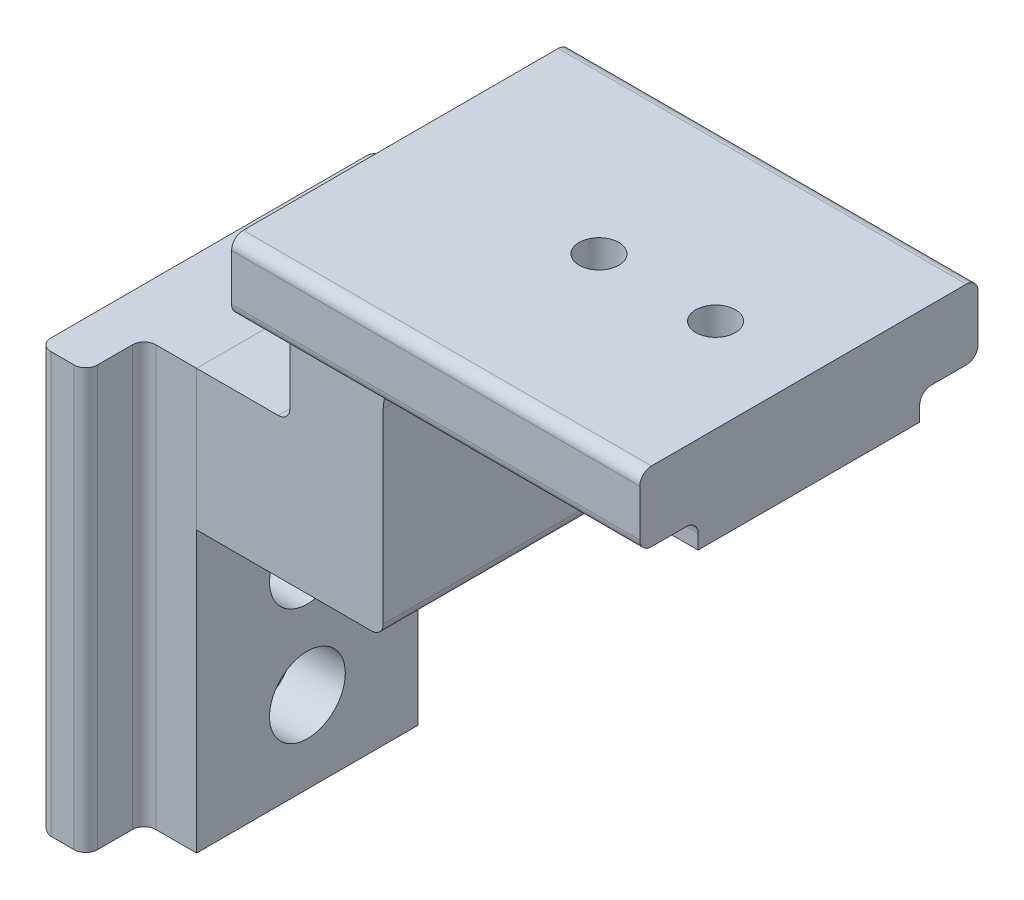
ISO-10303-21;
HEADER;
FILE_DESCRIPTION(('STEP AP214'),'2;1');
FILE_NAME('part.step','',(''),(''),'','','');
FILE_SCHEMA(('AUTOMOTIVE_DESIGN { 1 0 10303 214 1 1 1 1 }'));
ENDSEC;
DATA;
#1=APPLICATION_CONTEXT('core data for automotive mechanical design processes');
#2=APPLICATION_PROTOCOL_DEFINITION('international standard','automotive_design',2000,#1);
#3=PRODUCT_CONTEXT('',#1,'mechanical');
#4=PRODUCT('Part','Part','',(#3));
#5=PRODUCT_RELATED_PRODUCT_CATEGORY('part','',(#4));
#6=PRODUCT_DEFINITION_FORMATION('','',#4);
#7=PRODUCT_DEFINITION_CONTEXT('part definition',#1,'design');
#8=PRODUCT_DEFINITION('design','',#6,#7);
#9=PRODUCT_DEFINITION_SHAPE('','',#8);
#10=(LENGTH_UNIT() NAMED_UNIT(*) SI_UNIT(.MILLI.,.METRE.));
#11=(NAMED_UNIT(*) PLANE_ANGLE_UNIT() SI_UNIT($,.RADIAN.));
#12=(NAMED_UNIT(*) SI_UNIT($,.STERADIAN.) SOLID_ANGLE_UNIT());
#13=UNCERTAINTY_MEASURE_WITH_UNIT(LENGTH_MEASURE(1.E-05),#10,'distance_accuracy_value','');
#14=(GEOMETRIC_REPRESENTATION_CONTEXT(3) GLOBAL_UNCERTAINTY_ASSIGNED_CONTEXT((#13)) GLOBAL_UNIT_ASSIGNED_CONTEXT((#10,
#11,#12)) REPRESENTATION_CONTEXT('',''));
#15=CARTESIAN_POINT('',(0.,0.,0.));
#16=DIRECTION('',(0.,0.,1.));
#17=DIRECTION('',(1.,0.,0.));
#18=AXIS2_PLACEMENT_3D('',#15,#16,#17);
#19=CARTESIAN_POINT('',(0.,0.,0.));
#20=DIRECTION('',(1.,0.,0.));
#21=DIRECTION('',(0.,0.,-1.));
#22=AXIS2_PLACEMENT_3D('',#19,#20,#21);
#23=PLANE('',#22);
#24=DIRECTION('',(0.,0.,1.));
#25=VECTOR('',#24,1.);
#26=CARTESIAN_POINT('',(0.,6.,10.));
#27=LINE('',#26,#25);
#28=CARTESIAN_POINT('',(0.,6.,-9.5));
#29=VERTEX_POINT('',#28);
#30=CARTESIAN_POINT('',(0.,6.,9.5));
#31=VERTEX_POINT('',#30);
#32=EDGE_CURVE('E162',#29,#31,#27,.T.);
#33=ORIENTED_EDGE('',*,*,#32,.T.);
#34=DIRECTION('',(0.,1.,0.));
#35=VECTOR('',#34,1.);
#36=CARTESIAN_POINT('',(0.,-30.,9.5));
#37=LINE('',#36,#35);
#38=CARTESIAN_POINT('',(0.,-30.,9.5));
#39=VERTEX_POINT('',#38);
#40=EDGE_CURVE('E147',#39,#31,#37,.T.);
#41=ORIENTED_EDGE('',*,*,#40,.F.);
#42=DIRECTION('',(0.,0.,-1.));
#43=VECTOR('',#42,1.);
#44=CARTESIAN_POINT('',(0.,-30.,-10.));
#45=LINE('',#44,#43);
#46=CARTESIAN_POINT('',(0.,-30.,-9.5));
#47=VERTEX_POINT('',#46);
#48=EDGE_CURVE('E259',#39,#47,#45,.T.);
#49=ORIENTED_EDGE('',*,*,#48,.T.);
#50=DIRECTION('',(0.,1.,0.));
#51=VECTOR('',#50,1.);
#52=CARTESIAN_POINT('',(0.,-30.,-9.5));
#53=LINE('',#52,#51);
#54=EDGE_CURVE('E157',#47,#29,#53,.T.);
#55=ORIENTED_EDGE('',*,*,#54,.T.);
#56=EDGE_LOOP('',(#33,#41,#49,#55));
#57=FACE_BOUND('',#56,.T.);
#58=CARTESIAN_POINT('',(0.,0.,-5.));
#59=DIRECTION('',(1.,0.,0.));
#60=DIRECTION('',(0.,0.,-1.));
#61=AXIS2_PLACEMENT_3D('',#58,#59,#60);
#62=CIRCLE('',#61,1.25);
#63=CARTESIAN_POINT('',(0.,0.,-6.25));
#64=VERTEX_POINT('',#63);
#65=EDGE_CURVE('E174',#64,#64,#62,.F.);
#66=ORIENTED_EDGE('',*,*,#65,.T.);
#67=EDGE_LOOP('',(#66));
#68=FACE_BOUND('',#67,.T.);
#69=CARTESIAN_POINT('',(0.,0.,5.));
#70=DIRECTION('',(1.,0.,0.));
#71=DIRECTION('',(0.,0.,-1.));
#72=AXIS2_PLACEMENT_3D('',#69,#70,#71);
#73=CIRCLE('',#72,1.25);
#74=CARTESIAN_POINT('',(0.,0.,3.75));
#75=VERTEX_POINT('',#74);
#76=EDGE_CURVE('E170',#75,#75,#73,.F.);
#77=ORIENTED_EDGE('',*,*,#76,.T.);
#78=EDGE_LOOP('',(#77));
#79=FACE_BOUND('',#78,.T.);
#80=CARTESIAN_POINT('',(0.,-13.,0.));
#81=DIRECTION('',(1.,0.,0.));
#82=DIRECTION('',(0.,0.,-1.));
#83=AXIS2_PLACEMENT_3D('',#80,#81,#82);
#84=CIRCLE('',#83,3.25);
#85=CARTESIAN_POINT('',(0.,-13.,-3.25));
#86=VERTEX_POINT('',#85);
#87=EDGE_CURVE('E298',#86,#86,#84,.T.);
#88=ORIENTED_EDGE('',*,*,#87,.F.);
#89=EDGE_LOOP('',(#88));
#90=FACE_BOUND('',#89,.T.);
#91=CARTESIAN_POINT('',(0.,-23.,0.));
#92=DIRECTION('',(1.,0.,0.));
#93=DIRECTION('',(0.,0.,-1.));
#94=AXIS2_PLACEMENT_3D('',#91,#92,#93);
#95=CIRCLE('',#94,3.25);
#96=CARTESIAN_POINT('',(0.,-23.,-3.25));
#97=VERTEX_POINT('',#96);
#98=EDGE_CURVE('E306',#97,#97,#95,.T.);
#99=ORIENTED_EDGE('',*,*,#98,.F.);
#100=EDGE_LOOP('',(#99));
#101=FACE_BOUND('',#100,.T.);
#102=ADVANCED_FACE('F51',(#57,#68,#79,#90,#101),#23,.T.);
#103=CARTESIAN_POINT('',(-4.5,1.7,5.));
#104=DIRECTION('',(1.,0.,0.));
#105=DIRECTION('',(0.,0.,-1.));
#106=AXIS2_PLACEMENT_3D('',#103,#104,#105);
#107=PLANE('',#106);
#108=CARTESIAN_POINT('',(-4.5,0.,5.));
#109=DIRECTION('',(-1.,0.,0.));
#110=DIRECTION('',(0.,0.,1.));
#111=AXIS2_PLACEMENT_3D('',#108,#109,#110);
#112=CIRCLE('',#111,1.7);
#113=CARTESIAN_POINT('',(-4.5,0.,6.69999999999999));
#114=VERTEX_POINT('',#113);
#115=EDGE_CURVE('E320',#114,#114,#112,.T.);
#116=ORIENTED_EDGE('',*,*,#115,.F.);
#117=EDGE_LOOP('',(#116));
#118=FACE_BOUND('',#117,.T.);
#119=CARTESIAN_POINT('',(-4.5,0.,5.));
#120=DIRECTION('',(-1.,0.,0.));
#121=DIRECTION('',(0.,0.,1.));
#122=AXIS2_PLACEMENT_3D('',#119,#120,#121);
#123=CIRCLE('',#122,3.25);
#124=CARTESIAN_POINT('',(-4.5,0.,8.25));
#125=VERTEX_POINT('',#124);
#126=EDGE_CURVE('E323',#125,#125,#123,.T.);
#127=ORIENTED_EDGE('',*,*,#126,.T.);
#128=EDGE_LOOP('',(#127));
#129=FACE_BOUND('',#128,.T.);
#130=ADVANCED_FACE('F203',(#118,#129),#107,.F.);
#131=CARTESIAN_POINT('',(-9.,0.,5.));
#132=DIRECTION('',(-1.,0.,0.));
#133=DIRECTION('',(0.,0.,1.));
#134=AXIS2_PLACEMENT_3D('',#131,#132,#133);
#135=CYLINDRICAL_SURFACE('',#134,1.7);
#136=CARTESIAN_POINT('',(-4.,0.,5.));
#137=DIRECTION('',(-1.,0.,0.));
#138=DIRECTION('',(0.,0.,1.));
#139=AXIS2_PLACEMENT_3D('',#136,#137,#138);
#140=CIRCLE('',#139,1.7);
#141=CARTESIAN_POINT('',(-4.,0.,6.69999999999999));
#142=VERTEX_POINT('',#141);
#143=EDGE_CURVE('E297',#142,#142,#140,.T.);
#144=ORIENTED_EDGE('',*,*,#143,.F.);
#145=EDGE_LOOP('',(#144));
#146=FACE_BOUND('',#145,.T.);
#147=ORIENTED_EDGE('',*,*,#115,.T.);
#148=EDGE_LOOP('',(#147));
#149=FACE_BOUND('',#148,.T.);
#150=ADVANCED_FACE('F205',(#146,#149),#135,.F.);
#151=CARTESIAN_POINT('',(-4.,0.,5.));
#152=DIRECTION('',(-1.,0.,0.));
#153=DIRECTION('',(0.,0.,1.));
#154=AXIS2_PLACEMENT_3D('',#151,#152,#153);
#155=CONICAL_SURFACE('',#154,1.7,1.02974425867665);
#156=ORIENTED_EDGE('',*,*,#143,.T.);
#157=EDGE_LOOP('',(#156));
#158=FACE_BOUND('',#157,.T.);
#159=CARTESIAN_POINT('',(-3.7296127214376,0.,5.));
#160=DIRECTION('',(-1.,0.,0.));
#161=DIRECTION('',(0.,0.,1.));
#162=AXIS2_PLACEMENT_3D('',#159,#160,#161);
#163=CIRCLE('',#162,1.25);
#164=CARTESIAN_POINT('',(-3.7296127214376,0.,6.25));
#165=VERTEX_POINT('',#164);
#166=EDGE_CURVE('E294',#165,#165,#163,.T.);
#167=ORIENTED_EDGE('',*,*,#166,.F.);
#168=EDGE_LOOP('',(#167));
#169=FACE_BOUND('',#168,.T.);
#170=ADVANCED_FACE('F212',(#158,#169),#155,.F.);
#171=CARTESIAN_POINT('',(-9.,0.,5.));
#172=DIRECTION('',(-1.,0.,0.));
#173=DIRECTION('',(0.,0.,1.));
#174=AXIS2_PLACEMENT_3D('',#171,#172,#173);
#175=CYLINDRICAL_SURFACE('',#174,1.25);
#176=ORIENTED_EDGE('',*,*,#166,.T.);
#177=EDGE_LOOP('',(#176));
#178=FACE_BOUND('',#177,.T.);
#179=ORIENTED_EDGE('',*,*,#76,.F.);
#180=EDGE_LOOP('',(#179));
#181=FACE_BOUND('',#180,.T.);
#182=ADVANCED_FACE('F232',(#178,#181),#175,.F.);
#183=CARTESIAN_POINT('',(-4.5,1.7,-5.));
#184=DIRECTION('',(1.,0.,0.));
#185=DIRECTION('',(0.,0.,-1.));
#186=AXIS2_PLACEMENT_3D('',#183,#184,#185);
#187=PLANE('',#186);
#188=CARTESIAN_POINT('',(-4.5,0.,-5.));
#189=DIRECTION('',(-1.,0.,0.));
#190=DIRECTION('',(0.,0.,1.));
#191=AXIS2_PLACEMENT_3D('',#188,#189,#190);
#192=CIRCLE('',#191,1.7);
#193=CARTESIAN_POINT('',(-4.5,0.,-3.3));
#194=VERTEX_POINT('',#193);
#195=EDGE_CURVE('E253',#194,#194,#192,.T.);
#196=ORIENTED_EDGE('',*,*,#195,.F.);
#197=EDGE_LOOP('',(#196));
#198=FACE_BOUND('',#197,.T.);
#199=CARTESIAN_POINT('',(-4.5,0.,-5.));
#200=DIRECTION('',(-1.,0.,0.));
#201=DIRECTION('',(0.,0.,1.));
#202=AXIS2_PLACEMENT_3D('',#199,#200,#201);
#203=CIRCLE('',#202,3.25);
#204=CARTESIAN_POINT('',(-4.5,0.,-1.75));
#205=VERTEX_POINT('',#204);
#206=EDGE_CURVE('E177',#205,#205,#203,.T.);
#207=ORIENTED_EDGE('',*,*,#206,.T.);
#208=EDGE_LOOP('',(#207));
#209=FACE_BOUND('',#208,.T.);
#210=ADVANCED_FACE('F228',(#198,#209),#187,.F.);
#211=CARTESIAN_POINT('',(-9.,0.,-5.));
#212=DIRECTION('',(-1.,0.,0.));
#213=DIRECTION('',(0.,0.,1.));
#214=AXIS2_PLACEMENT_3D('',#211,#212,#213);
#215=CYLINDRICAL_SURFACE('',#214,1.7);
#216=CARTESIAN_POINT('',(-4.,0.,-5.));
#217=DIRECTION('',(-1.,0.,0.));
#218=DIRECTION('',(0.,0.,1.));
#219=AXIS2_PLACEMENT_3D('',#216,#217,#218);
#220=CIRCLE('',#219,1.7);
#221=CARTESIAN_POINT('',(-4.,0.,-3.3));
#222=VERTEX_POINT('',#221);
#223=EDGE_CURVE('E293',#222,#222,#220,.T.);
#224=ORIENTED_EDGE('',*,*,#223,.F.);
#225=EDGE_LOOP('',(#224));
#226=FACE_BOUND('',#225,.T.);
#227=ORIENTED_EDGE('',*,*,#195,.T.);
#228=EDGE_LOOP('',(#227));
#229=FACE_BOUND('',#228,.T.);
#230=ADVANCED_FACE('F197',(#226,#229),#215,.F.);
#231=CARTESIAN_POINT('',(-4.,0.,-5.));
#232=DIRECTION('',(-1.,0.,0.));
#233=DIRECTION('',(0.,0.,1.));
#234=AXIS2_PLACEMENT_3D('',#231,#232,#233);
#235=CONICAL_SURFACE('',#234,1.7,1.02974425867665);
#236=ORIENTED_EDGE('',*,*,#223,.T.);
#237=EDGE_LOOP('',(#236));
#238=FACE_BOUND('',#237,.T.);
#239=CARTESIAN_POINT('',(-3.7296127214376,0.,-5.));
#240=DIRECTION('',(-1.,0.,0.));
#241=DIRECTION('',(0.,0.,1.));
#242=AXIS2_PLACEMENT_3D('',#239,#240,#241);
#243=CIRCLE('',#242,1.25);
#244=CARTESIAN_POINT('',(-3.7296127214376,0.,-3.75));
#245=VERTEX_POINT('',#244);
#246=EDGE_CURVE('E291',#245,#245,#243,.T.);
#247=ORIENTED_EDGE('',*,*,#246,.F.);
#248=EDGE_LOOP('',(#247));
#249=FACE_BOUND('',#248,.T.);
#250=ADVANCED_FACE('F187',(#238,#249),#235,.F.);
#251=CARTESIAN_POINT('',(-9.,0.,-5.));
#252=DIRECTION('',(-1.,0.,0.));
#253=DIRECTION('',(0.,0.,1.));
#254=AXIS2_PLACEMENT_3D('',#251,#252,#253);
#255=CYLINDRICAL_SURFACE('',#254,1.25);
#256=ORIENTED_EDGE('',*,*,#246,.T.);
#257=EDGE_LOOP('',(#256));
#258=FACE_BOUND('',#257,.T.);
#259=ORIENTED_EDGE('',*,*,#65,.F.);
#260=EDGE_LOOP('',(#259));
#261=FACE_BOUND('',#260,.T.);
#262=ADVANCED_FACE('F184',(#258,#261),#255,.F.);
#263=CARTESIAN_POINT('',(0.,-23.,0.));
#264=DIRECTION('',(1.,0.,0.));
#265=DIRECTION('',(0.,0.,-1.));
#266=AXIS2_PLACEMENT_3D('',#263,#264,#265);
#267=CYLINDRICAL_SURFACE('',#266,1.7);
#268=CARTESIAN_POINT('',(-8.5,-23.,0.));
#269=DIRECTION('',(-1.,0.,0.));
#270=DIRECTION('',(0.,0.,1.));
#271=AXIS2_PLACEMENT_3D('',#268,#269,#270);
#272=CIRCLE('',#271,1.7);
#273=CARTESIAN_POINT('',(-8.5,-23.,1.7));
#274=VERTEX_POINT('',#273);
#275=EDGE_CURVE('E290',#274,#274,#272,.F.);
#276=ORIENTED_EDGE('',*,*,#275,.F.);
#277=EDGE_LOOP('',(#276));
#278=FACE_BOUND('',#277,.T.);
#279=CARTESIAN_POINT('',(-4.5,-23.,0.));
#280=DIRECTION('',(1.,0.,0.));
#281=DIRECTION('',(0.,0.,-1.));
#282=AXIS2_PLACEMENT_3D('',#279,#280,#281);
#283=CIRCLE('',#282,1.7);
#284=CARTESIAN_POINT('',(-4.5,-23.,-1.7));
#285=VERTEX_POINT('',#284);
#286=EDGE_CURVE('E300',#285,#285,#283,.T.);
#287=ORIENTED_EDGE('',*,*,#286,.T.);
#288=EDGE_LOOP('',(#287));
#289=FACE_BOUND('',#288,.T.);
#290=ADVANCED_FACE('F186',(#278,#289),#267,.F.);
#291=CARTESIAN_POINT('',(-4.5,-21.3,0.));
#292=DIRECTION('',(-1.,0.,0.));
#293=DIRECTION('',(0.,0.,1.));
#294=AXIS2_PLACEMENT_3D('',#291,#292,#293);
#295=PLANE('',#294);
#296=ORIENTED_EDGE('',*,*,#286,.F.);
#297=EDGE_LOOP('',(#296));
#298=FACE_BOUND('',#297,.T.);
#299=CARTESIAN_POINT('',(-4.5,-23.,0.));
#300=DIRECTION('',(1.,0.,0.));
#301=DIRECTION('',(0.,0.,-1.));
#302=AXIS2_PLACEMENT_3D('',#299,#300,#301);
#303=CIRCLE('',#302,3.25);
#304=CARTESIAN_POINT('',(-4.5,-23.,-3.25));
#305=VERTEX_POINT('',#304);
#306=EDGE_CURVE('E303',#305,#305,#303,.T.);
#307=ORIENTED_EDGE('',*,*,#306,.T.);
#308=EDGE_LOOP('',(#307));
#309=FACE_BOUND('',#308,.T.);
#310=ADVANCED_FACE('F194',(#298,#309),#295,.F.);
#311=CARTESIAN_POINT('',(0.,-23.,0.));
#312=DIRECTION('',(1.,0.,0.));
#313=DIRECTION('',(0.,0.,-1.));
#314=AXIS2_PLACEMENT_3D('',#311,#312,#313);
#315=CYLINDRICAL_SURFACE('',#314,3.25);
#316=ORIENTED_EDGE('',*,*,#306,.F.);
#317=EDGE_LOOP('',(#316));
#318=FACE_BOUND('',#317,.T.);
#319=ORIENTED_EDGE('',*,*,#98,.T.);
#320=EDGE_LOOP('',(#319));
#321=FACE_BOUND('',#320,.T.);
#322=ADVANCED_FACE('F464',(#318,#321),#315,.F.);
#323=CARTESIAN_POINT('',(0.,-13.,0.));
#324=DIRECTION('',(1.,0.,0.));
#325=DIRECTION('',(0.,0.,-1.));
#326=AXIS2_PLACEMENT_3D('',#323,#324,#325);
#327=CYLINDRICAL_SURFACE('',#326,1.7);
#328=CARTESIAN_POINT('',(-8.5,-13.,0.));
#329=DIRECTION('',(-1.,0.,0.));
#330=DIRECTION('',(0.,0.,1.));
#331=AXIS2_PLACEMENT_3D('',#328,#329,#330);
#332=CIRCLE('',#331,1.7);
#333=CARTESIAN_POINT('',(-8.5,-13.,1.7));
#334=VERTEX_POINT('',#333);
#335=EDGE_CURVE('E309',#334,#334,#332,.F.);
#336=ORIENTED_EDGE('',*,*,#335,.F.);
#337=EDGE_LOOP('',(#336));
#338=FACE_BOUND('',#337,.T.);
#339=CARTESIAN_POINT('',(-4.5,-13.,0.));
#340=DIRECTION('',(1.,0.,0.));
#341=DIRECTION('',(0.,0.,-1.));
#342=AXIS2_PLACEMENT_3D('',#339,#340,#341);
#343=CIRCLE('',#342,1.7);
#344=CARTESIAN_POINT('',(-4.5,-13.,-1.7));
#345=VERTEX_POINT('',#344);
#346=EDGE_CURVE('E310',#345,#345,#343,.T.);
#347=ORIENTED_EDGE('',*,*,#346,.T.);
#348=EDGE_LOOP('',(#347));
#349=FACE_BOUND('',#348,.T.);
#350=ADVANCED_FACE('F468',(#338,#349),#327,.F.);
#351=CARTESIAN_POINT('',(-4.5,-11.3,0.));
#352=DIRECTION('',(-1.,0.,0.));
#353=DIRECTION('',(0.,0.,1.));
#354=AXIS2_PLACEMENT_3D('',#351,#352,#353);
#355=PLANE('',#354);
#356=ORIENTED_EDGE('',*,*,#346,.F.);
#357=EDGE_LOOP('',(#356));
#358=FACE_BOUND('',#357,.T.);
#359=CARTESIAN_POINT('',(-4.5,-13.,0.));
#360=DIRECTION('',(1.,0.,0.));
#361=DIRECTION('',(0.,0.,-1.));
#362=AXIS2_PLACEMENT_3D('',#359,#360,#361);
#363=CIRCLE('',#362,3.25);
#364=CARTESIAN_POINT('',(-4.5,-13.,-3.25));
#365=VERTEX_POINT('',#364);
#366=EDGE_CURVE('E313',#365,#365,#363,.T.);
#367=ORIENTED_EDGE('',*,*,#366,.T.);
#368=EDGE_LOOP('',(#367));
#369=FACE_BOUND('',#368,.T.);
#370=ADVANCED_FACE('F472',(#358,#369),#355,.F.);
#371=CARTESIAN_POINT('',(0.,-13.,0.));
#372=DIRECTION('',(1.,0.,0.));
#373=DIRECTION('',(0.,0.,-1.));
#374=AXIS2_PLACEMENT_3D('',#371,#372,#373);
#375=CYLINDRICAL_SURFACE('',#374,3.25);
#376=ORIENTED_EDGE('',*,*,#366,.F.);
#377=EDGE_LOOP('',(#376));
#378=FACE_BOUND('',#377,.T.);
#379=ORIENTED_EDGE('',*,*,#87,.T.);
#380=EDGE_LOOP('',(#379));
#381=FACE_BOUND('',#380,.T.);
#382=ADVANCED_FACE('F223',(#378,#381),#375,.F.);
#383=CARTESIAN_POINT('',(-9.,0.,5.));
#384=DIRECTION('',(-1.,0.,0.));
#385=DIRECTION('',(0.,0.,1.));
#386=AXIS2_PLACEMENT_3D('',#383,#384,#385);
#387=CYLINDRICAL_SURFACE('',#386,3.25);
#388=ORIENTED_EDGE('',*,*,#126,.F.);
#389=EDGE_LOOP('',(#388));
#390=FACE_BOUND('',#389,.T.);
#391=CARTESIAN_POINT('',(-8.5,0.,5.));
#392=DIRECTION('',(-1.,0.,0.));
#393=DIRECTION('',(0.,0.,1.));
#394=AXIS2_PLACEMENT_3D('',#391,#392,#393);
#395=CIRCLE('',#394,3.25);
#396=CARTESIAN_POINT('',(-8.5,0.,8.25));
#397=VERTEX_POINT('',#396);
#398=EDGE_CURVE('E256',#397,#397,#395,.T.);
#399=ORIENTED_EDGE('',*,*,#398,.T.);
#400=EDGE_LOOP('',(#399));
#401=FACE_BOUND('',#400,.T.);
#402=ADVANCED_FACE('F220',(#390,#401),#387,.F.);
#403=CARTESIAN_POINT('',(-9.,0.,-5.));
#404=DIRECTION('',(-1.,0.,0.));
#405=DIRECTION('',(0.,0.,1.));
#406=AXIS2_PLACEMENT_3D('',#403,#404,#405);
#407=CYLINDRICAL_SURFACE('',#406,3.25);
#408=ORIENTED_EDGE('',*,*,#206,.F.);
#409=EDGE_LOOP('',(#408));
#410=FACE_BOUND('',#409,.T.);
#411=CARTESIAN_POINT('',(-8.5,0.,-5.));
#412=DIRECTION('',(-1.,0.,0.));
#413=DIRECTION('',(0.,0.,1.));
#414=AXIS2_PLACEMENT_3D('',#411,#412,#413);
#415=CIRCLE('',#414,3.25);
#416=CARTESIAN_POINT('',(-8.5,0.,-1.75));
#417=VERTEX_POINT('',#416);
#418=EDGE_CURVE('E248',#417,#417,#415,.T.);
#419=ORIENTED_EDGE('',*,*,#418,.T.);
#420=EDGE_LOOP('',(#419));
#421=FACE_BOUND('',#420,.T.);
#422=ADVANCED_FACE('F222',(#410,#421),#407,.F.);
#423=CARTESIAN_POINT('',(-7.5,-30.,13.5));
#424=DIRECTION('',(0.,1.,0.));
#425=DIRECTION('',(0.,0.,1.));
#426=AXIS2_PLACEMENT_3D('',#423,#424,#425);
#427=CYLINDRICAL_SURFACE('',#426,1.);
#428=CARTESIAN_POINT('',(-7.5,-29.,13.5));
#429=DIRECTION('',(0.,-0.707106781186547,-0.707106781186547));
#430=DIRECTION('',(0.,0.707106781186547,-0.707106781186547));
#431=AXIS2_PLACEMENT_3D('',#428,#429,#430);
#432=ELLIPSE('',#431,1.41421356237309,1.);
#433=CARTESIAN_POINT('',(-8.5,-29.,13.5));
#434=VERTEX_POINT('',#433);
#435=CARTESIAN_POINT('',(-7.5,-30.,14.5));
#436=VERTEX_POINT('',#435);
#437=EDGE_CURVE('E14',#434,#436,#432,.F.);
#438=ORIENTED_EDGE('',*,*,#437,.T.);
#439=DIRECTION('',(0.,1.,0.));
#440=VECTOR('',#439,1.);
#441=CARTESIAN_POINT('',(-7.5,-30.,14.5));
#442=LINE('',#441,#440);
#443=CARTESIAN_POINT('',(-7.5,6.,14.5));
#444=VERTEX_POINT('',#443);
#445=EDGE_CURVE('E369',#444,#436,#442,.F.);
#446=ORIENTED_EDGE('',*,*,#445,.F.);
#447=CARTESIAN_POINT('',(-7.5,6.,13.5));
#448=DIRECTION('',(0.,-1.,0.));
#449=DIRECTION('',(0.,0.,-1.));
#450=AXIS2_PLACEMENT_3D('',#447,#448,#449);
#451=CIRCLE('',#450,1.);
#452=CARTESIAN_POINT('',(-8.5,6.,13.5));
#453=VERTEX_POINT('',#452);
#454=EDGE_CURVE('E365',#453,#444,#451,.F.);
#455=ORIENTED_EDGE('',*,*,#454,.F.);
#456=DIRECTION('',(0.,1.,0.));
#457=VECTOR('',#456,1.);
#458=CARTESIAN_POINT('',(-8.5,-30.,13.5));
#459=LINE('',#458,#457);
#460=EDGE_CURVE('E354',#434,#453,#459,.T.);
#461=ORIENTED_EDGE('',*,*,#460,.F.);
#462=EDGE_LOOP('',(#438,#446,#455,#461));
#463=FACE_BOUND('',#462,.T.);
#464=ADVANCED_FACE('F235',(#463),#427,.T.);
#465=CARTESIAN_POINT('',(-8.5,-30.,-15.));
#466=DIRECTION('',(-1.,0.,0.));
#467=DIRECTION('',(0.,0.,1.));
#468=AXIS2_PLACEMENT_3D('',#465,#466,#467);
#469=PLANE('',#468);
#470=ORIENTED_EDGE('',*,*,#418,.F.);
#471=EDGE_LOOP('',(#470));
#472=FACE_BOUND('',#471,.T.);
#473=ORIENTED_EDGE('',*,*,#398,.F.);
#474=EDGE_LOOP('',(#473));
#475=FACE_BOUND('',#474,.T.);
#476=ORIENTED_EDGE('',*,*,#335,.T.);
#477=EDGE_LOOP('',(#476));
#478=FACE_BOUND('',#477,.T.);
#479=ORIENTED_EDGE('',*,*,#275,.T.);
#480=EDGE_LOOP('',(#479));
#481=FACE_BOUND('',#480,.T.);
#482=DIRECTION('',(0.,0.,1.));
#483=VECTOR('',#482,1.);
#484=CARTESIAN_POINT('',(-8.5,-29.,14.5));
#485=LINE('',#484,#483);
#486=CARTESIAN_POINT('',(-8.5,-29.,-13.5));
#487=VERTEX_POINT('',#486);
#488=EDGE_CURVE('E351',#487,#434,#485,.T.);
#489=ORIENTED_EDGE('',*,*,#488,.T.);
#490=ORIENTED_EDGE('',*,*,#460,.T.);
#491=DIRECTION('',(0.,0.,-1.));
#492=VECTOR('',#491,1.);
#493=CARTESIAN_POINT('',(-8.5,6.,10.));
#494=LINE('',#493,#492);
#495=CARTESIAN_POINT('',(-8.5,6.,-13.5));
#496=VERTEX_POINT('',#495);
#497=EDGE_CURVE('E280',#453,#496,#494,.T.);
#498=ORIENTED_EDGE('',*,*,#497,.T.);
#499=DIRECTION('',(0.,1.,0.));
#500=VECTOR('',#499,1.);
#501=CARTESIAN_POINT('',(-8.5,-30.,-13.5));
#502=LINE('',#501,#500);
#503=EDGE_CURVE('E357',#496,#487,#502,.F.);
#504=ORIENTED_EDGE('',*,*,#503,.T.);
#505=EDGE_LOOP('',(#489,#490,#498,#504));
#506=FACE_BOUND('',#505,.T.);
#507=ADVANCED_FACE('F240',(#472,#475,#478,#481,#506),#469,.T.);
#508=CARTESIAN_POINT('',(-7.5,-30.,-13.5));
#509=DIRECTION('',(0.,1.,0.));
#510=DIRECTION('',(0.,0.,1.));
#511=AXIS2_PLACEMENT_3D('',#508,#509,#510);
#512=CYLINDRICAL_SURFACE('',#511,1.);
#513=CARTESIAN_POINT('',(-7.5,6.,-13.5));
#514=DIRECTION('',(0.,-1.,0.));
#515=DIRECTION('',(0.,0.,-1.));
#516=AXIS2_PLACEMENT_3D('',#513,#514,#515);
#517=CIRCLE('',#516,1.);
#518=CARTESIAN_POINT('',(-7.5,6.,-14.5));
#519=VERTEX_POINT('',#518);
#520=EDGE_CURVE('E377',#519,#496,#517,.F.);
#521=ORIENTED_EDGE('',*,*,#520,.F.);
#522=DIRECTION('',(0.,1.,0.));
#523=VECTOR('',#522,1.);
#524=CARTESIAN_POINT('',(-7.5,-30.,-14.5));
#525=LINE('',#524,#523);
#526=CARTESIAN_POINT('',(-7.5,-30.,-14.5));
#527=VERTEX_POINT('',#526);
#528=EDGE_CURVE('E408',#527,#519,#525,.T.);
#529=ORIENTED_EDGE('',*,*,#528,.F.);
#530=CARTESIAN_POINT('',(-7.5,-29.,-13.5));
#531=DIRECTION('',(0.,0.707106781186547,-0.707106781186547));
#532=DIRECTION('',(0.,0.707106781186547,0.707106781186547));
#533=AXIS2_PLACEMENT_3D('',#530,#531,#532);
#534=ELLIPSE('',#533,1.41421356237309,1.);
#535=EDGE_CURVE('E61',#487,#527,#534,.F.);
#536=ORIENTED_EDGE('',*,*,#535,.F.);
#537=ORIENTED_EDGE('',*,*,#503,.F.);
#538=EDGE_LOOP('',(#521,#529,#536,#537));
#539=FACE_BOUND('',#538,.T.);
#540=ADVANCED_FACE('F341',(#539),#512,.T.);
#541=CARTESIAN_POINT('',(0.,6.,10.));
#542=DIRECTION('',(0.,-1.,0.));
#543=DIRECTION('',(0.,0.,-1.));
#544=AXIS2_PLACEMENT_3D('',#541,#542,#543);
#545=PLANE('',#544);
#546=ORIENTED_EDGE('',*,*,#32,.F.);
#547=DIRECTION('',(-1.,0.,0.));
#548=VECTOR('',#547,1.);
#549=CARTESIAN_POINT('',(0.,6.,-9.5));
#550=LINE('',#549,#548);
#551=CARTESIAN_POINT('',(-3.5,6.,-9.5));
#552=VERTEX_POINT('',#551);
#553=EDGE_CURVE('E55',#29,#552,#550,.T.);
#554=ORIENTED_EDGE('',*,*,#553,.T.);
#555=CARTESIAN_POINT('',(-3.5,6.,-10.5));
#556=DIRECTION('',(0.,-1.,0.));
#557=DIRECTION('',(0.,0.,-1.));
#558=AXIS2_PLACEMENT_3D('',#555,#556,#557);
#559=CIRCLE('',#558,1.);
#560=CARTESIAN_POINT('',(-4.5,6.,-10.5));
#561=VERTEX_POINT('',#560);
#562=EDGE_CURVE('E394',#552,#561,#559,.T.);
#563=ORIENTED_EDGE('',*,*,#562,.T.);
#564=DIRECTION('',(0.,0.,1.));
#565=VECTOR('',#564,1.);
#566=CARTESIAN_POINT('',(-4.5,6.,10.));
#567=LINE('',#566,#565);
#568=CARTESIAN_POINT('',(-4.5,6.,-13.5));
#569=VERTEX_POINT('',#568);
#570=EDGE_CURVE('E267',#569,#561,#567,.T.);
#571=ORIENTED_EDGE('',*,*,#570,.F.);
#572=CARTESIAN_POINT('',(-5.5,6.,-13.5));
#573=DIRECTION('',(0.,-1.,0.));
#574=DIRECTION('',(0.,0.,-1.));
#575=AXIS2_PLACEMENT_3D('',#572,#573,#574);
#576=CIRCLE('',#575,1.);
#577=CARTESIAN_POINT('',(-5.5,6.,-14.5));
#578=VERTEX_POINT('',#577);
#579=EDGE_CURVE('E375',#569,#578,#576,.F.);
#580=ORIENTED_EDGE('',*,*,#579,.T.);
#581=DIRECTION('',(1.,0.,0.));
#582=VECTOR('',#581,1.);
#583=CARTESIAN_POINT('',(0.,6.,-14.5));
#584=LINE('',#583,#582);
#585=EDGE_CURVE('E283',#519,#578,#584,.T.);
#586=ORIENTED_EDGE('',*,*,#585,.F.);
#587=ORIENTED_EDGE('',*,*,#520,.T.);
#588=ORIENTED_EDGE('',*,*,#497,.F.);
#589=ORIENTED_EDGE('',*,*,#454,.T.);
#590=DIRECTION('',(-1.,0.,0.));
#591=VECTOR('',#590,1.);
#592=CARTESIAN_POINT('',(0.,6.,14.5));
#593=LINE('',#592,#591);
#594=CARTESIAN_POINT('',(-5.5,6.,14.5));
#595=VERTEX_POINT('',#594);
#596=EDGE_CURVE('E276',#595,#444,#593,.T.);
#597=ORIENTED_EDGE('',*,*,#596,.F.);
#598=CARTESIAN_POINT('',(-5.5,6.,13.5));
#599=DIRECTION('',(0.,-1.,0.));
#600=DIRECTION('',(0.,0.,-1.));
#601=AXIS2_PLACEMENT_3D('',#598,#599,#600);
#602=CIRCLE('',#601,1.);
#603=CARTESIAN_POINT('',(-4.5,6.,13.5));
#604=VERTEX_POINT('',#603);
#605=EDGE_CURVE('E379',#595,#604,#602,.F.);
#606=ORIENTED_EDGE('',*,*,#605,.T.);
#607=DIRECTION('',(0.,0.,1.));
#608=VECTOR('',#607,1.);
#609=CARTESIAN_POINT('',(-4.5,6.,10.));
#610=LINE('',#609,#608);
#611=CARTESIAN_POINT('',(-4.5,6.,10.5));
#612=VERTEX_POINT('',#611);
#613=EDGE_CURVE('E279',#612,#604,#610,.T.);
#614=ORIENTED_EDGE('',*,*,#613,.F.);
#615=CARTESIAN_POINT('',(-3.5,6.,10.5));
#616=DIRECTION('',(0.,-1.,0.));
#617=DIRECTION('',(0.,0.,-1.));
#618=AXIS2_PLACEMENT_3D('',#615,#616,#617);
#619=CIRCLE('',#618,1.);
#620=CARTESIAN_POINT('',(-3.5,6.,9.5));
#621=VERTEX_POINT('',#620);
#622=EDGE_CURVE('E165',#612,#621,#619,.T.);
#623=ORIENTED_EDGE('',*,*,#622,.T.);
#624=DIRECTION('',(-1.,0.,0.));
#625=VECTOR('',#624,1.);
#626=CARTESIAN_POINT('',(0.,6.,9.5));
#627=LINE('',#626,#625);
#628=EDGE_CURVE('E150',#31,#621,#627,.T.);
#629=ORIENTED_EDGE('',*,*,#628,.F.);
#630=EDGE_LOOP('',(#546,#554,#563,#571,#580,#586,#587,#588,#589,#597,#606,#614,#623,#629));
#631=FACE_BOUND('',#630,.T.);
#632=ADVANCED_FACE('F161',(#631),#545,.F.);
#633=CARTESIAN_POINT('',(-5.5,-30.,13.5));
#634=DIRECTION('',(0.,1.,0.));
#635=DIRECTION('',(0.,0.,1.));
#636=AXIS2_PLACEMENT_3D('',#633,#634,#635);
#637=CYLINDRICAL_SURFACE('',#636,1.);
#638=CARTESIAN_POINT('',(-5.5,-30.,13.5));
#639=DIRECTION('',(0.,1.,0.));
#640=DIRECTION('',(0.,0.,1.));
#641=AXIS2_PLACEMENT_3D('',#638,#639,#640);
#642=CIRCLE('',#641,1.);
#643=CARTESIAN_POINT('',(-4.5,-30.,13.5));
#644=VERTEX_POINT('',#643);
#645=CARTESIAN_POINT('',(-5.5,-30.,14.5));
#646=VERTEX_POINT('',#645);
#647=EDGE_CURVE('E417',#644,#646,#642,.F.);
#648=ORIENTED_EDGE('',*,*,#647,.F.);
#649=DIRECTION('',(0.,1.,0.));
#650=VECTOR('',#649,1.);
#651=CARTESIAN_POINT('',(-4.5,-30.,13.5));
#652=LINE('',#651,#650);
#653=EDGE_CURVE('E397',#604,#644,#652,.F.);
#654=ORIENTED_EDGE('',*,*,#653,.F.);
#655=ORIENTED_EDGE('',*,*,#605,.F.);
#656=DIRECTION('',(0.,1.,0.));
#657=VECTOR('',#656,1.);
#658=CARTESIAN_POINT('',(-5.5,-30.,14.5));
#659=LINE('',#658,#657);
#660=EDGE_CURVE('E366',#646,#595,#659,.T.);
#661=ORIENTED_EDGE('',*,*,#660,.F.);
#662=EDGE_LOOP('',(#648,#654,#655,#661));
#663=FACE_BOUND('',#662,.T.);
#664=ADVANCED_FACE('F429',(#663),#637,.T.);
#665=CARTESIAN_POINT('',(-4.5,-30.,15.));
#666=DIRECTION('',(1.,0.,0.));
#667=DIRECTION('',(0.,0.,-1.));
#668=AXIS2_PLACEMENT_3D('',#665,#666,#667);
#669=PLANE('',#668);
#670=ORIENTED_EDGE('',*,*,#613,.T.);
#671=ORIENTED_EDGE('',*,*,#653,.T.);
#672=DIRECTION('',(0.,0.,-1.));
#673=VECTOR('',#672,1.);
#674=CARTESIAN_POINT('',(-4.5,-30.,0.));
#675=LINE('',#674,#673);
#676=CARTESIAN_POINT('',(-4.5,-30.,10.5));
#677=VERTEX_POINT('',#676);
#678=EDGE_CURVE('E258',#644,#677,#675,.T.);
#679=ORIENTED_EDGE('',*,*,#678,.T.);
#680=DIRECTION('',(0.,1.,0.));
#681=VECTOR('',#680,1.);
#682=CARTESIAN_POINT('',(-4.5,-30.,10.5));
#683=LINE('',#682,#681);
#684=EDGE_CURVE('E399',#677,#612,#683,.T.);
#685=ORIENTED_EDGE('',*,*,#684,.T.);
#686=EDGE_LOOP('',(#670,#671,#679,#685));
#687=FACE_BOUND('',#686,.T.);
#688=ADVANCED_FACE('F449',(#687),#669,.T.);
#689=CARTESIAN_POINT('',(-3.5,-30.,10.5));
#690=DIRECTION('',(0.,1.,0.));
#691=DIRECTION('',(0.,0.,1.));
#692=AXIS2_PLACEMENT_3D('',#689,#690,#691);
#693=CYLINDRICAL_SURFACE('',#692,1.);
#694=CARTESIAN_POINT('',(-3.5,-30.,10.5));
#695=DIRECTION('',(0.,1.,0.));
#696=DIRECTION('',(0.,0.,1.));
#697=AXIS2_PLACEMENT_3D('',#694,#695,#696);
#698=CIRCLE('',#697,1.);
#699=CARTESIAN_POINT('',(-3.5,-30.,9.5));
#700=VERTEX_POINT('',#699);
#701=EDGE_CURVE('E169',#700,#677,#698,.T.);
#702=ORIENTED_EDGE('',*,*,#701,.F.);
#703=DIRECTION('',(0.,1.,0.));
#704=VECTOR('',#703,1.);
#705=CARTESIAN_POINT('',(-3.5,0.,9.5));
#706=LINE('',#705,#704);
#707=EDGE_CURVE('E381',#621,#700,#706,.F.);
#708=ORIENTED_EDGE('',*,*,#707,.F.);
#709=ORIENTED_EDGE('',*,*,#622,.F.);
#710=ORIENTED_EDGE('',*,*,#684,.F.);
#711=EDGE_LOOP('',(#702,#708,#709,#710));
#712=FACE_BOUND('',#711,.T.);
#713=ADVANCED_FACE('F447',(#712),#693,.F.);
#714=CARTESIAN_POINT('',(0.,0.,9.5));
#715=DIRECTION('',(0.,0.,-1.));
#716=DIRECTION('',(-1.,0.,0.));
#717=AXIS2_PLACEMENT_3D('',#714,#715,#716);
#718=PLANE('',#717);
#719=ORIENTED_EDGE('',*,*,#40,.T.);
#720=ORIENTED_EDGE('',*,*,#628,.T.);
#721=ORIENTED_EDGE('',*,*,#707,.T.);
#722=DIRECTION('',(1.,0.,0.));
#723=VECTOR('',#722,1.);
#724=CARTESIAN_POINT('',(0.,-30.,9.5));
#725=LINE('',#724,#723);
#726=EDGE_CURVE('E68',#700,#39,#725,.T.);
#727=ORIENTED_EDGE('',*,*,#726,.T.);
#728=EDGE_LOOP('',(#719,#720,#721,#727));
#729=FACE_BOUND('',#728,.T.);
#730=ADVANCED_FACE('F149',(#729),#718,.F.);
#731=CARTESIAN_POINT('',(0.,0.,-9.5));
#732=DIRECTION('',(0.,0.,-1.));
#733=DIRECTION('',(-1.,0.,0.));
#734=AXIS2_PLACEMENT_3D('',#731,#732,#733);
#735=PLANE('',#734);
#736=ORIENTED_EDGE('',*,*,#553,.F.);
#737=ORIENTED_EDGE('',*,*,#54,.F.);
#738=DIRECTION('',(-1.,0.,0.));
#739=VECTOR('',#738,1.);
#740=CARTESIAN_POINT('',(0.,-30.,-9.5));
#741=LINE('',#740,#739);
#742=CARTESIAN_POINT('',(-3.5,-30.,-9.5));
#743=VERTEX_POINT('',#742);
#744=EDGE_CURVE('E156',#47,#743,#741,.T.);
#745=ORIENTED_EDGE('',*,*,#744,.T.);
#746=DIRECTION('',(0.,1.,0.));
#747=VECTOR('',#746,1.);
#748=CARTESIAN_POINT('',(-3.5,6.,-9.5));
#749=LINE('',#748,#747);
#750=EDGE_CURVE('E167',#743,#552,#749,.T.);
#751=ORIENTED_EDGE('',*,*,#750,.T.);
#752=EDGE_LOOP('',(#736,#737,#745,#751));
#753=FACE_BOUND('',#752,.T.);
#754=ADVANCED_FACE('F53',(#753),#735,.T.);
#755=CARTESIAN_POINT('',(-3.5,0.,-10.5));
#756=DIRECTION('',(0.,-1.,0.));
#757=DIRECTION('',(0.,0.,-1.));
#758=AXIS2_PLACEMENT_3D('',#755,#756,#757);
#759=CYLINDRICAL_SURFACE('',#758,1.);
#760=CARTESIAN_POINT('',(-3.5,-30.,-10.5));
#761=DIRECTION('',(0.,1.,0.));
#762=DIRECTION('',(0.,0.,1.));
#763=AXIS2_PLACEMENT_3D('',#760,#761,#762);
#764=CIRCLE('',#763,1.);
#765=CARTESIAN_POINT('',(-4.5,-30.,-10.5));
#766=VERTEX_POINT('',#765);
#767=EDGE_CURVE('E393',#766,#743,#764,.T.);
#768=ORIENTED_EDGE('',*,*,#767,.F.);
#769=DIRECTION('',(0.,1.,0.));
#770=VECTOR('',#769,1.);
#771=CARTESIAN_POINT('',(-4.5,-30.,-10.5));
#772=LINE('',#771,#770);
#773=EDGE_CURVE('E395',#561,#766,#772,.F.);
#774=ORIENTED_EDGE('',*,*,#773,.F.);
#775=ORIENTED_EDGE('',*,*,#562,.F.);
#776=ORIENTED_EDGE('',*,*,#750,.F.);
#777=EDGE_LOOP('',(#768,#774,#775,#776));
#778=FACE_BOUND('',#777,.T.);
#779=ADVANCED_FACE('F391',(#778),#759,.F.);
#780=CARTESIAN_POINT('',(-4.5,-30.,-10.));
#781=DIRECTION('',(1.,0.,0.));
#782=DIRECTION('',(0.,0.,-1.));
#783=AXIS2_PLACEMENT_3D('',#780,#781,#782);
#784=PLANE('',#783);
#785=ORIENTED_EDGE('',*,*,#570,.T.);
#786=ORIENTED_EDGE('',*,*,#773,.T.);
#787=DIRECTION('',(0.,0.,-1.));
#788=VECTOR('',#787,1.);
#789=CARTESIAN_POINT('',(-4.5,-30.,0.));
#790=LINE('',#789,#788);
#791=CARTESIAN_POINT('',(-4.5,-30.,-13.5));
#792=VERTEX_POINT('',#791);
#793=EDGE_CURVE('E264',#766,#792,#790,.T.);
#794=ORIENTED_EDGE('',*,*,#793,.T.);
#795=DIRECTION('',(0.,1.,0.));
#796=VECTOR('',#795,1.);
#797=CARTESIAN_POINT('',(-4.5,-30.,-13.5));
#798=LINE('',#797,#796);
#799=EDGE_CURVE('E411',#792,#569,#798,.T.);
#800=ORIENTED_EDGE('',*,*,#799,.T.);
#801=EDGE_LOOP('',(#785,#786,#794,#800));
#802=FACE_BOUND('',#801,.T.);
#803=ADVANCED_FACE('F442',(#802),#784,.T.);
#804=CARTESIAN_POINT('',(-5.5,-30.,-13.5));
#805=DIRECTION('',(0.,1.,0.));
#806=DIRECTION('',(0.,0.,1.));
#807=AXIS2_PLACEMENT_3D('',#804,#805,#806);
#808=CYLINDRICAL_SURFACE('',#807,1.);
#809=CARTESIAN_POINT('',(-5.5,-30.,-13.5));
#810=DIRECTION('',(0.,1.,0.));
#811=DIRECTION('',(0.,0.,1.));
#812=AXIS2_PLACEMENT_3D('',#809,#810,#811);
#813=CIRCLE('',#812,1.);
#814=CARTESIAN_POINT('',(-5.5,-30.,-14.5));
#815=VERTEX_POINT('',#814);
#816=EDGE_CURVE('E415',#815,#792,#813,.F.);
#817=ORIENTED_EDGE('',*,*,#816,.F.);
#818=DIRECTION('',(0.,1.,0.));
#819=VECTOR('',#818,1.);
#820=CARTESIAN_POINT('',(-5.5,-30.,-14.5));
#821=LINE('',#820,#819);
#822=EDGE_CURVE('E406',#578,#815,#821,.F.);
#823=ORIENTED_EDGE('',*,*,#822,.F.);
#824=ORIENTED_EDGE('',*,*,#579,.F.);
#825=ORIENTED_EDGE('',*,*,#799,.F.);
#826=EDGE_LOOP('',(#817,#823,#824,#825));
#827=FACE_BOUND('',#826,.T.);
#828=ADVANCED_FACE('F440',(#827),#808,.T.);
#829=CARTESIAN_POINT('',(-4.,-30.,-14.5));
#830=DIRECTION('',(0.,0.,-1.));
#831=DIRECTION('',(-1.,0.,0.));
#832=AXIS2_PLACEMENT_3D('',#829,#830,#831);
#833=PLANE('',#832);
#834=ORIENTED_EDGE('',*,*,#585,.T.);
#835=ORIENTED_EDGE('',*,*,#822,.T.);
#836=DIRECTION('',(-1.,0.,0.));
#837=VECTOR('',#836,1.);
#838=CARTESIAN_POINT('',(0.,-30.,-14.5));
#839=LINE('',#838,#837);
#840=EDGE_CURVE('E268',#815,#527,#839,.T.);
#841=ORIENTED_EDGE('',*,*,#840,.T.);
#842=ORIENTED_EDGE('',*,*,#528,.T.);
#843=EDGE_LOOP('',(#834,#835,#841,#842));
#844=FACE_BOUND('',#843,.T.);
#845=ADVANCED_FACE('F435',(#844),#833,.T.);
#846=CARTESIAN_POINT('',(-7.5,-29.,-15.));
#847=DIRECTION('',(0.,0.,-1.));
#848=DIRECTION('',(-1.,0.,0.));
#849=AXIS2_PLACEMENT_3D('',#846,#847,#848);
#850=CYLINDRICAL_SURFACE('',#849,1.);
#851=ORIENTED_EDGE('',*,*,#535,.T.);
#852=DIRECTION('',(0.,0.,1.));
#853=VECTOR('',#852,1.);
#854=CARTESIAN_POINT('',(-7.5,-30.,-14.5));
#855=LINE('',#854,#853);
#856=EDGE_CURVE('E363',#436,#527,#855,.F.);
#857=ORIENTED_EDGE('',*,*,#856,.F.);
#858=ORIENTED_EDGE('',*,*,#437,.F.);
#859=ORIENTED_EDGE('',*,*,#488,.F.);
#860=EDGE_LOOP('',(#851,#857,#858,#859));
#861=FACE_BOUND('',#860,.T.);
#862=ADVANCED_FACE('F362',(#861),#850,.T.);
#863=CARTESIAN_POINT('',(-9.,-30.,14.5));
#864=DIRECTION('',(0.,0.,1.));
#865=DIRECTION('',(1.,0.,0.));
#866=AXIS2_PLACEMENT_3D('',#863,#864,#865);
#867=PLANE('',#866);
#868=ORIENTED_EDGE('',*,*,#596,.T.);
#869=ORIENTED_EDGE('',*,*,#445,.T.);
#870=DIRECTION('',(1.,0.,0.));
#871=VECTOR('',#870,1.);
#872=CARTESIAN_POINT('',(0.,-30.,14.5));
#873=LINE('',#872,#871);
#874=EDGE_CURVE('E271',#436,#646,#873,.T.);
#875=ORIENTED_EDGE('',*,*,#874,.T.);
#876=ORIENTED_EDGE('',*,*,#660,.T.);
#877=EDGE_LOOP('',(#868,#869,#875,#876));
#878=FACE_BOUND('',#877,.T.);
#879=ADVANCED_FACE('F420',(#878),#867,.T.);
#880=CARTESIAN_POINT('',(0.,-30.,0.));
#881=DIRECTION('',(0.,1.,0.));
#882=DIRECTION('',(0.,0.,1.));
#883=AXIS2_PLACEMENT_3D('',#880,#881,#882);
#884=PLANE('',#883);
#885=ORIENTED_EDGE('',*,*,#874,.F.);
#886=ORIENTED_EDGE('',*,*,#856,.T.);
#887=ORIENTED_EDGE('',*,*,#840,.F.);
#888=ORIENTED_EDGE('',*,*,#816,.T.);
#889=ORIENTED_EDGE('',*,*,#793,.F.);
#890=ORIENTED_EDGE('',*,*,#767,.T.);
#891=ORIENTED_EDGE('',*,*,#744,.F.);
#892=ORIENTED_EDGE('',*,*,#48,.F.);
#893=ORIENTED_EDGE('',*,*,#726,.F.);
#894=ORIENTED_EDGE('',*,*,#701,.T.);
#895=ORIENTED_EDGE('',*,*,#678,.F.);
#896=ORIENTED_EDGE('',*,*,#647,.T.);
#897=EDGE_LOOP('',(#885,#886,#887,#888,#889,#890,#891,#892,#893,#894,#895,#896));
#898=FACE_BOUND('',#897,.T.);
#899=ADVANCED_FACE('F215',(#898),#884,.F.);
#900=CLOSED_SHELL('',(#102,#130,#150,#170,#182,#210,#230,#250,#262,#290,#310,#322,#350,#370,
#382,#402,#422,#464,#507,#540,#632,#664,#688,#713,#730,#754,#779,#803,#828,#845,#862,#879,#899));
#901=MANIFOLD_SOLID_BREP('B2',#900);
#902=CARTESIAN_POINT('',(0.,0.,0.));
#903=DIRECTION('',(1.,0.,0.));
#904=DIRECTION('',(0.,0.,-1.));
#905=AXIS2_PLACEMENT_3D('',#902,#903,#904);
#906=PLANE('',#905);
#907=CARTESIAN_POINT('',(0.,0.,5.));
#908=DIRECTION('',(1.,0.,0.));
#909=DIRECTION('',(0.,0.,-1.));
#910=AXIS2_PLACEMENT_3D('',#907,#908,#909);
#911=CIRCLE('',#910,1.25);
#912=CARTESIAN_POINT('',(0.,0.,3.75));
#913=VERTEX_POINT('',#912);
#914=EDGE_CURVE('E1136',#913,#913,#911,.F.);
#915=ORIENTED_EDGE('',*,*,#914,.F.);
#916=EDGE_LOOP('',(#915));
#917=FACE_BOUND('',#916,.T.);
#918=CARTESIAN_POINT('',(0.,0.,-5.));
#919=DIRECTION('',(1.,0.,0.));
#920=DIRECTION('',(0.,0.,-1.));
#921=AXIS2_PLACEMENT_3D('',#918,#919,#920);
#922=CIRCLE('',#921,1.25);
#923=CARTESIAN_POINT('',(0.,0.,-6.25));
#924=VERTEX_POINT('',#923);
#925=EDGE_CURVE('E1133',#924,#924,#922,.F.);
#926=ORIENTED_EDGE('',*,*,#925,.F.);
#927=EDGE_LOOP('',(#926));
#928=FACE_BOUND('',#927,.T.);
#929=DIRECTION('',(0.,0.,1.));
#930=VECTOR('',#929,1.);
#931=CARTESIAN_POINT('',(0.,6.,10.));
#932=LINE('',#931,#930);
#933=CARTESIAN_POINT('',(0.,6.,-9.5));
#934=VERTEX_POINT('',#933);
#935=CARTESIAN_POINT('',(0.,6.,9.5));
#936=VERTEX_POINT('',#935);
#937=EDGE_CURVE('E800',#934,#936,#932,.T.);
#938=ORIENTED_EDGE('',*,*,#937,.F.);
#939=DIRECTION('',(0.,-1.,0.));
#940=VECTOR('',#939,1.);
#941=CARTESIAN_POINT('',(0.,0.,-9.5));
#942=LINE('',#941,#940);
#943=CARTESIAN_POINT('',(0.,-6.,-9.5));
#944=VERTEX_POINT('',#943);
#945=EDGE_CURVE('E49',#934,#944,#942,.T.);
#946=ORIENTED_EDGE('',*,*,#945,.T.);
#947=DIRECTION('',(0.,0.,-1.));
#948=VECTOR('',#947,1.);
#949=CARTESIAN_POINT('',(0.,-6.,10.));
#950=LINE('',#949,#948);
#951=CARTESIAN_POINT('',(0.,-6.,9.5));
#952=VERTEX_POINT('',#951);
#953=EDGE_CURVE('E983',#952,#944,#950,.T.);
#954=ORIENTED_EDGE('',*,*,#953,.F.);
#955=DIRECTION('',(0.,-1.,0.));
#956=VECTOR('',#955,1.);
#957=CARTESIAN_POINT('',(0.,0.,9.5));
#958=LINE('',#957,#956);
#959=EDGE_CURVE('E817',#936,#952,#958,.T.);
#960=ORIENTED_EDGE('',*,*,#959,.F.);
#961=EDGE_LOOP('',(#938,#946,#954,#960));
#962=FACE_BOUND('',#961,.T.);
#963=ADVANCED_FACE('F797',(#917,#928,#962),#906,.F.);
#964=CARTESIAN_POINT('',(4.24892422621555,0.,-5.));
#965=DIRECTION('',(-1.,0.,0.));
#966=DIRECTION('',(0.,0.,1.));
#967=AXIS2_PLACEMENT_3D('',#964,#965,#966);
#968=CONICAL_SURFACE('',#967,1.25,1.02974425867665);
#969=CARTESIAN_POINT('',(5.,0.,-5.));
#970=VERTEX_POINT('',#969);
#971=VERTEX_LOOP('',#970);
#972=FACE_BOUND('',#971,.T.);
#973=CARTESIAN_POINT('',(4.24892422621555,0.,-5.));
#974=DIRECTION('',(-1.,0.,0.));
#975=DIRECTION('',(0.,0.,1.));
#976=AXIS2_PLACEMENT_3D('',#973,#974,#975);
#977=CIRCLE('',#976,1.25);
#978=CARTESIAN_POINT('',(4.24892422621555,0.,-3.75));
#979=VERTEX_POINT('',#978);
#980=EDGE_CURVE('E951',#979,#979,#977,.T.);
#981=ORIENTED_EDGE('',*,*,#980,.T.);
#982=EDGE_LOOP('',(#981));
#983=FACE_BOUND('',#982,.T.);
#984=ADVANCED_FACE('F944',(#972,#983),#968,.F.);
#985=CARTESIAN_POINT('',(-9.,0.,-5.));
#986=DIRECTION('',(-1.,0.,0.));
#987=DIRECTION('',(0.,0.,1.));
#988=AXIS2_PLACEMENT_3D('',#985,#986,#987);
#989=CYLINDRICAL_SURFACE('',#988,1.25);
#990=ORIENTED_EDGE('',*,*,#925,.T.);
#991=EDGE_LOOP('',(#990));
#992=FACE_BOUND('',#991,.T.);
#993=ORIENTED_EDGE('',*,*,#980,.F.);
#994=EDGE_LOOP('',(#993));
#995=FACE_BOUND('',#994,.T.);
#996=ADVANCED_FACE('F947',(#992,#995),#989,.F.);
#997=CARTESIAN_POINT('',(4.24892422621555,0.,5.));
#998=DIRECTION('',(-1.,0.,0.));
#999=DIRECTION('',(0.,0.,1.));
#1000=AXIS2_PLACEMENT_3D('',#997,#998,#999);
#1001=CONICAL_SURFACE('',#1000,1.25,1.02974425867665);
#1002=CARTESIAN_POINT('',(5.,0.,5.));
#1003=VERTEX_POINT('',#1002);
#1004=VERTEX_LOOP('',#1003);
#1005=FACE_BOUND('',#1004,.T.);
#1006=CARTESIAN_POINT('',(4.24892422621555,0.,5.));
#1007=DIRECTION('',(-1.,0.,0.));
#1008=DIRECTION('',(0.,0.,1.));
#1009=AXIS2_PLACEMENT_3D('',#1006,#1007,#1008);
#1010=CIRCLE('',#1009,1.25);
#1011=CARTESIAN_POINT('',(4.24892422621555,0.,6.24999999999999));
#1012=VERTEX_POINT('',#1011);
#1013=EDGE_CURVE('E953',#1012,#1012,#1010,.T.);
#1014=ORIENTED_EDGE('',*,*,#1013,.T.);
#1015=EDGE_LOOP('',(#1014));
#1016=FACE_BOUND('',#1015,.T.);
#1017=ADVANCED_FACE('F1307',(#1005,#1016),#1001,.F.);
#1018=CARTESIAN_POINT('',(-9.,0.,5.));
#1019=DIRECTION('',(-1.,0.,0.));
#1020=DIRECTION('',(0.,0.,1.));
#1021=AXIS2_PLACEMENT_3D('',#1018,#1019,#1020);
#1022=CYLINDRICAL_SURFACE('',#1021,1.25);
#1023=ORIENTED_EDGE('',*,*,#914,.T.);
#1024=EDGE_LOOP('',(#1023));
#1025=FACE_BOUND('',#1024,.T.);
#1026=ORIENTED_EDGE('',*,*,#1013,.F.);
#1027=EDGE_LOOP('',(#1026));
#1028=FACE_BOUND('',#1027,.T.);
#1029=ADVANCED_FACE('F1272',(#1025,#1028),#1022,.F.);
#1030=CARTESIAN_POINT('',(16.,14.,10.));
#1031=DIRECTION('',(-1.,0.,0.));
#1032=DIRECTION('',(0.,0.,1.));
#1033=AXIS2_PLACEMENT_3D('',#1030,#1031,#1032);
#1034=PLANE('',#1033);
#1035=DIRECTION('',(0.,1.,0.));
#1036=VECTOR('',#1035,1.);
#1037=CARTESIAN_POINT('',(16.,0.,-9.5));
#1038=LINE('',#1037,#1036);
#1039=CARTESIAN_POINT('',(16.,-5.,-9.5));
#1040=VERTEX_POINT('',#1039);
#1041=CARTESIAN_POINT('',(16.,11.,-9.5));
#1042=VERTEX_POINT('',#1041);
#1043=EDGE_CURVE('E1012',#1040,#1042,#1038,.T.);
#1044=ORIENTED_EDGE('',*,*,#1043,.T.);
#1045=DIRECTION('',(0.,0.,-1.));
#1046=VECTOR('',#1045,1.);
#1047=CARTESIAN_POINT('',(16.,11.,10.));
#1048=LINE('',#1047,#1046);
#1049=CARTESIAN_POINT('',(16.,11.,9.5));
#1050=VERTEX_POINT('',#1049);
#1051=EDGE_CURVE('E1127',#1042,#1050,#1048,.F.);
#1052=ORIENTED_EDGE('',*,*,#1051,.T.);
#1053=DIRECTION('',(0.,1.,0.));
#1054=VECTOR('',#1053,1.);
#1055=CARTESIAN_POINT('',(16.,0.,9.5));
#1056=LINE('',#1055,#1054);
#1057=CARTESIAN_POINT('',(16.,-5.,9.5));
#1058=VERTEX_POINT('',#1057);
#1059=EDGE_CURVE('E993',#1058,#1050,#1056,.T.);
#1060=ORIENTED_EDGE('',*,*,#1059,.F.);
#1061=DIRECTION('',(0.,0.,-1.));
#1062=VECTOR('',#1061,1.);
#1063=CARTESIAN_POINT('',(16.,-5.,10.));
#1064=LINE('',#1063,#1062);
#1065=EDGE_CURVE('E985',#1058,#1040,#1064,.T.);
#1066=ORIENTED_EDGE('',*,*,#1065,.T.);
#1067=EDGE_LOOP('',(#1044,#1052,#1060,#1066));
#1068=FACE_BOUND('',#1067,.T.);
#1069=ADVANCED_FACE('F1216',(#1068),#1034,.F.);
#1070=CARTESIAN_POINT('',(8.,6.,10.));
#1071=DIRECTION('',(1.,0.,0.));
#1072=DIRECTION('',(0.,0.,-1.));
#1073=AXIS2_PLACEMENT_3D('',#1070,#1071,#1072);
#1074=PLANE('',#1073);
#1075=DIRECTION('',(0.,-1.,0.));
#1076=VECTOR('',#1075,1.);
#1077=CARTESIAN_POINT('',(8.,0.,-9.5));
#1078=LINE('',#1077,#1076);
#1079=CARTESIAN_POINT('',(8.,15.25,-9.5));
#1080=VERTEX_POINT('',#1079);
#1081=CARTESIAN_POINT('',(8.,7.,-9.5));
#1082=VERTEX_POINT('',#1081);
#1083=EDGE_CURVE('E1008',#1080,#1082,#1078,.T.);
#1084=ORIENTED_EDGE('',*,*,#1083,.T.);
#1085=DIRECTION('',(0.,0.,-1.));
#1086=VECTOR('',#1085,1.);
#1087=CARTESIAN_POINT('',(8.,7.,9.5));
#1088=LINE('',#1087,#1086);
#1089=CARTESIAN_POINT('',(8.,7.,9.5));
#1090=VERTEX_POINT('',#1089);
#1091=EDGE_CURVE('E1077',#1082,#1090,#1088,.F.);
#1092=ORIENTED_EDGE('',*,*,#1091,.T.);
#1093=DIRECTION('',(0.,-1.,0.));
#1094=VECTOR('',#1093,1.);
#1095=CARTESIAN_POINT('',(8.,0.,9.5));
#1096=LINE('',#1095,#1094);
#1097=CARTESIAN_POINT('',(8.,15.25,9.5));
#1098=VERTEX_POINT('',#1097);
#1099=EDGE_CURVE('E990',#1098,#1090,#1096,.T.);
#1100=ORIENTED_EDGE('',*,*,#1099,.F.);
#1101=CARTESIAN_POINT('',(8.,15.25,10.5));
#1102=DIRECTION('',(1.,0.,0.));
#1103=DIRECTION('',(0.,0.,-1.));
#1104=AXIS2_PLACEMENT_3D('',#1101,#1102,#1103);
#1105=CIRCLE('',#1104,1.);
#1106=CARTESIAN_POINT('',(8.,16.25,10.5));
#1107=VERTEX_POINT('',#1106);
#1108=EDGE_CURVE('E1120',#1098,#1107,#1105,.T.);
#1109=ORIENTED_EDGE('',*,*,#1108,.T.);
#1110=DIRECTION('',(0.,0.,-1.));
#1111=VECTOR('',#1110,1.);
#1112=CARTESIAN_POINT('',(8.,16.25,10.));
#1113=LINE('',#1112,#1111);
#1114=CARTESIAN_POINT('',(8.,16.25,13.5));
#1115=VERTEX_POINT('',#1114);
#1116=EDGE_CURVE('E982',#1115,#1107,#1113,.T.);
#1117=ORIENTED_EDGE('',*,*,#1116,.F.);
#1118=CARTESIAN_POINT('',(8.,17.25,13.5));
#1119=DIRECTION('',(1.,0.,0.));
#1120=DIRECTION('',(0.,0.,-1.));
#1121=AXIS2_PLACEMENT_3D('',#1118,#1119,#1120);
#1122=CIRCLE('',#1121,1.);
#1123=CARTESIAN_POINT('',(8.,17.25,14.5));
#1124=VERTEX_POINT('',#1123);
#1125=EDGE_CURVE('E1069',#1115,#1124,#1122,.F.);
#1126=ORIENTED_EDGE('',*,*,#1125,.T.);
#1127=DIRECTION('',(0.,-1.,0.));
#1128=VECTOR('',#1127,1.);
#1129=CARTESIAN_POINT('',(8.,6.,14.5));
#1130=LINE('',#1129,#1128);
#1131=CARTESIAN_POINT('',(8.,21.25,14.5));
#1132=VERTEX_POINT('',#1131);
#1133=EDGE_CURVE('E996',#1132,#1124,#1130,.T.);
#1134=ORIENTED_EDGE('',*,*,#1133,.F.);
#1135=CARTESIAN_POINT('',(8.,21.25,13.5));
#1136=DIRECTION('',(1.,0.,0.));
#1137=DIRECTION('',(0.,0.,-1.));
#1138=AXIS2_PLACEMENT_3D('',#1135,#1136,#1137);
#1139=CIRCLE('',#1138,1.);
#1140=CARTESIAN_POINT('',(8.,22.25,13.5));
#1141=VERTEX_POINT('',#1140);
#1142=EDGE_CURVE('E1071',#1132,#1141,#1139,.F.);
#1143=ORIENTED_EDGE('',*,*,#1142,.T.);
#1144=DIRECTION('',(0.,0.,1.));
#1145=VECTOR('',#1144,1.);
#1146=CARTESIAN_POINT('',(8.,22.25,10.));
#1147=LINE('',#1146,#1145);
#1148=CARTESIAN_POINT('',(8.,22.25,-13.5));
#1149=VERTEX_POINT('',#1148);
#1150=EDGE_CURVE('E999',#1149,#1141,#1147,.T.);
#1151=ORIENTED_EDGE('',*,*,#1150,.F.);
#1152=CARTESIAN_POINT('',(8.,21.25,-13.5));
#1153=DIRECTION('',(1.,0.,0.));
#1154=DIRECTION('',(0.,0.,-1.));
#1155=AXIS2_PLACEMENT_3D('',#1152,#1153,#1154);
#1156=CIRCLE('',#1155,1.);
#1157=CARTESIAN_POINT('',(8.,21.25,-14.5));
#1158=VERTEX_POINT('',#1157);
#1159=EDGE_CURVE('E1073',#1149,#1158,#1156,.F.);
#1160=ORIENTED_EDGE('',*,*,#1159,.T.);
#1161=DIRECTION('',(0.,1.,0.));
#1162=VECTOR('',#1161,1.);
#1163=CARTESIAN_POINT('',(8.,6.,-14.5));
#1164=LINE('',#1163,#1162);
#1165=CARTESIAN_POINT('',(8.,17.25,-14.5));
#1166=VERTEX_POINT('',#1165);
#1167=EDGE_CURVE('E1002',#1166,#1158,#1164,.T.);
#1168=ORIENTED_EDGE('',*,*,#1167,.F.);
#1169=CARTESIAN_POINT('',(8.,17.25,-13.5));
#1170=DIRECTION('',(1.,0.,0.));
#1171=DIRECTION('',(0.,0.,-1.));
#1172=AXIS2_PLACEMENT_3D('',#1169,#1170,#1171);
#1173=CIRCLE('',#1172,1.);
#1174=CARTESIAN_POINT('',(8.,16.25,-13.5));
#1175=VERTEX_POINT('',#1174);
#1176=EDGE_CURVE('E1075',#1166,#1175,#1173,.F.);
#1177=ORIENTED_EDGE('',*,*,#1176,.T.);
#1178=DIRECTION('',(0.,0.,-1.));
#1179=VECTOR('',#1178,1.);
#1180=CARTESIAN_POINT('',(8.,16.25,10.));
#1181=LINE('',#1180,#1179);
#1182=CARTESIAN_POINT('',(8.,16.25,-10.5));
#1183=VERTEX_POINT('',#1182);
#1184=EDGE_CURVE('E1005',#1183,#1175,#1181,.T.);
#1185=ORIENTED_EDGE('',*,*,#1184,.F.);
#1186=CARTESIAN_POINT('',(8.,15.25,-10.5));
#1187=DIRECTION('',(1.,0.,0.));
#1188=DIRECTION('',(0.,0.,-1.));
#1189=AXIS2_PLACEMENT_3D('',#1186,#1187,#1188);
#1190=CIRCLE('',#1189,1.);
#1191=EDGE_CURVE('E1116',#1183,#1080,#1190,.T.);
#1192=ORIENTED_EDGE('',*,*,#1191,.T.);
#1193=EDGE_LOOP('',(#1084,#1092,#1100,#1109,#1117,#1126,#1134,#1143,#1151,#1160,#1168,#1177,
#1185,#1192));
#1194=FACE_BOUND('',#1193,.T.);
#1195=ADVANCED_FACE('F1153',(#1194),#1074,.F.);
#1196=CARTESIAN_POINT('',(0.,6.,10.));
#1197=DIRECTION('',(0.,-1.,0.));
#1198=DIRECTION('',(0.,0.,-1.));
#1199=AXIS2_PLACEMENT_3D('',#1196,#1197,#1198);
#1200=PLANE('',#1199);
#1201=DIRECTION('',(-1.,0.,0.));
#1202=VECTOR('',#1201,1.);
#1203=CARTESIAN_POINT('',(0.,6.,-9.5));
#1204=LINE('',#1203,#1202);
#1205=CARTESIAN_POINT('',(7.,6.,-9.5));
#1206=VERTEX_POINT('',#1205);
#1207=EDGE_CURVE('E1011',#1206,#934,#1204,.T.);
#1208=ORIENTED_EDGE('',*,*,#1207,.T.);
#1209=ORIENTED_EDGE('',*,*,#937,.T.);
#1210=DIRECTION('',(-1.,0.,0.));
#1211=VECTOR('',#1210,1.);
#1212=CARTESIAN_POINT('',(0.,6.,9.5));
#1213=LINE('',#1212,#1211);
#1214=CARTESIAN_POINT('',(7.,6.,9.5));
#1215=VERTEX_POINT('',#1214);
#1216=EDGE_CURVE('E987',#1215,#936,#1213,.T.);
#1217=ORIENTED_EDGE('',*,*,#1216,.F.);
#1218=DIRECTION('',(0.,0.,-1.));
#1219=VECTOR('',#1218,1.);
#1220=CARTESIAN_POINT('',(7.,6.,-9.5));
#1221=LINE('',#1220,#1219);
#1222=EDGE_CURVE('E1066',#1215,#1206,#1221,.T.);
#1223=ORIENTED_EDGE('',*,*,#1222,.T.);
#1224=EDGE_LOOP('',(#1208,#1209,#1217,#1223));
#1225=FACE_BOUND('',#1224,.T.);
#1226=ADVANCED_FACE('F1141',(#1225),#1200,.F.);
#1227=CARTESIAN_POINT('',(16.,-6.,10.));
#1228=DIRECTION('',(0.,1.,0.));
#1229=DIRECTION('',(0.,0.,1.));
#1230=AXIS2_PLACEMENT_3D('',#1227,#1228,#1229);
#1231=PLANE('',#1230);
#1232=DIRECTION('',(1.,0.,0.));
#1233=VECTOR('',#1232,1.);
#1234=CARTESIAN_POINT('',(0.,-6.,-9.5));
#1235=LINE('',#1234,#1233);
#1236=CARTESIAN_POINT('',(15.,-6.,-9.5));
#1237=VERTEX_POINT('',#1236);
#1238=EDGE_CURVE('E1015',#944,#1237,#1235,.T.);
#1239=ORIENTED_EDGE('',*,*,#1238,.T.);
#1240=DIRECTION('',(0.,0.,-1.));
#1241=VECTOR('',#1240,1.);
#1242=CARTESIAN_POINT('',(15.,-6.,10.));
#1243=LINE('',#1242,#1241);
#1244=CARTESIAN_POINT('',(15.,-6.,9.5));
#1245=VERTEX_POINT('',#1244);
#1246=EDGE_CURVE('E1059',#1237,#1245,#1243,.F.);
#1247=ORIENTED_EDGE('',*,*,#1246,.T.);
#1248=DIRECTION('',(1.,0.,0.));
#1249=VECTOR('',#1248,1.);
#1250=CARTESIAN_POINT('',(0.,-6.,9.5));
#1251=LINE('',#1250,#1249);
#1252=EDGE_CURVE('E986',#952,#1245,#1251,.T.);
#1253=ORIENTED_EDGE('',*,*,#1252,.F.);
#1254=ORIENTED_EDGE('',*,*,#953,.T.);
#1255=EDGE_LOOP('',(#1239,#1247,#1253,#1254));
#1256=FACE_BOUND('',#1255,.T.);
#1257=ADVANCED_FACE('F1226',(#1256),#1231,.F.);
#1258=CARTESIAN_POINT('',(0.,0.,9.5));
#1259=DIRECTION('',(0.,0.,-1.));
#1260=DIRECTION('',(-1.,0.,0.));
#1261=AXIS2_PLACEMENT_3D('',#1258,#1259,#1260);
#1262=PLANE('',#1261);
#1263=ORIENTED_EDGE('',*,*,#1216,.T.);
#1264=ORIENTED_EDGE('',*,*,#959,.T.);
#1265=ORIENTED_EDGE('',*,*,#1252,.T.);
#1266=CARTESIAN_POINT('',(15.,-5.,9.5));
#1267=DIRECTION('',(0.,0.,-1.));
#1268=DIRECTION('',(-1.,0.,0.));
#1269=AXIS2_PLACEMENT_3D('',#1266,#1267,#1268);
#1270=CIRCLE('',#1269,1.);
#1271=EDGE_CURVE('E1064',#1245,#1058,#1270,.F.);
#1272=ORIENTED_EDGE('',*,*,#1271,.T.);
#1273=ORIENTED_EDGE('',*,*,#1059,.T.);
#1274=CARTESIAN_POINT('',(19.,11.,9.5));
#1275=DIRECTION('',(0.,0.,-1.));
#1276=DIRECTION('',(-1.,0.,0.));
#1277=AXIS2_PLACEMENT_3D('',#1274,#1275,#1276);
#1278=CIRCLE('',#1277,3.);
#1279=CARTESIAN_POINT('',(19.,14.,9.5));
#1280=VERTEX_POINT('',#1279);
#1281=EDGE_CURVE('E1131',#1050,#1280,#1278,.T.);
#1282=ORIENTED_EDGE('',*,*,#1281,.T.);
#1283=DIRECTION('',(-1.,0.,0.));
#1284=VECTOR('',#1283,1.);
#1285=CARTESIAN_POINT('',(0.,14.,9.5));
#1286=LINE('',#1285,#1284);
#1287=CARTESIAN_POINT('',(43.,14.,9.5));
#1288=VERTEX_POINT('',#1287);
#1289=EDGE_CURVE('E1023',#1288,#1280,#1286,.T.);
#1290=ORIENTED_EDGE('',*,*,#1289,.F.);
#1291=DIRECTION('',(0.,1.,0.));
#1292=VECTOR('',#1291,1.);
#1293=CARTESIAN_POINT('',(43.,0.,9.5));
#1294=LINE('',#1293,#1292);
#1295=CARTESIAN_POINT('',(43.,15.25,9.5));
#1296=VERTEX_POINT('',#1295);
#1297=EDGE_CURVE('E981',#1288,#1296,#1294,.T.);
#1298=ORIENTED_EDGE('',*,*,#1297,.T.);
#1299=DIRECTION('',(-1.,0.,0.));
#1300=VECTOR('',#1299,1.);
#1301=CARTESIAN_POINT('',(0.,15.25,9.5));
#1302=LINE('',#1301,#1300);
#1303=EDGE_CURVE('E1061',#1296,#1098,#1302,.T.);
#1304=ORIENTED_EDGE('',*,*,#1303,.T.);
#1305=ORIENTED_EDGE('',*,*,#1099,.T.);
#1306=CARTESIAN_POINT('',(7.,7.,9.5));
#1307=DIRECTION('',(0.,0.,-1.));
#1308=DIRECTION('',(-1.,0.,0.));
#1309=AXIS2_PLACEMENT_3D('',#1306,#1307,#1308);
#1310=CIRCLE('',#1309,1.);
#1311=EDGE_CURVE('E1114',#1090,#1215,#1310,.T.);
#1312=ORIENTED_EDGE('',*,*,#1311,.T.);
#1313=EDGE_LOOP('',(#1263,#1264,#1265,#1272,#1273,#1282,#1290,#1298,#1304,#1305,#1312));
#1314=FACE_BOUND('',#1313,.T.);
#1315=ADVANCED_FACE('F1143',(#1314),#1262,.F.);
#1316=CARTESIAN_POINT('',(0.,0.,-9.5));
#1317=DIRECTION('',(0.,0.,-1.));
#1318=DIRECTION('',(-1.,0.,0.));
#1319=AXIS2_PLACEMENT_3D('',#1316,#1317,#1318);
#1320=PLANE('',#1319);
#1321=ORIENTED_EDGE('',*,*,#945,.F.);
#1322=ORIENTED_EDGE('',*,*,#1207,.F.);
#1323=CARTESIAN_POINT('',(7.,7.,-9.5));
#1324=DIRECTION('',(0.,0.,-1.));
#1325=DIRECTION('',(-1.,0.,0.));
#1326=AXIS2_PLACEMENT_3D('',#1323,#1324,#1325);
#1327=CIRCLE('',#1326,1.);
#1328=EDGE_CURVE('E1112',#1206,#1082,#1327,.F.);
#1329=ORIENTED_EDGE('',*,*,#1328,.T.);
#1330=ORIENTED_EDGE('',*,*,#1083,.F.);
#1331=DIRECTION('',(-1.,0.,0.));
#1332=VECTOR('',#1331,1.);
#1333=CARTESIAN_POINT('',(43.,15.25,-9.5));
#1334=LINE('',#1333,#1332);
#1335=CARTESIAN_POINT('',(43.,15.25,-9.5));
#1336=VERTEX_POINT('',#1335);
#1337=EDGE_CURVE('E1055',#1080,#1336,#1334,.F.);
#1338=ORIENTED_EDGE('',*,*,#1337,.T.);
#1339=DIRECTION('',(0.,-1.,0.));
#1340=VECTOR('',#1339,1.);
#1341=CARTESIAN_POINT('',(43.,0.,-9.5));
#1342=LINE('',#1341,#1340);
#1343=CARTESIAN_POINT('',(43.,14.,-9.5));
#1344=VERTEX_POINT('',#1343);
#1345=EDGE_CURVE('E1024',#1336,#1344,#1342,.T.);
#1346=ORIENTED_EDGE('',*,*,#1345,.T.);
#1347=DIRECTION('',(-1.,0.,0.));
#1348=VECTOR('',#1347,1.);
#1349=CARTESIAN_POINT('',(0.,14.,-9.5));
#1350=LINE('',#1349,#1348);
#1351=CARTESIAN_POINT('',(19.,14.,-9.5));
#1352=VERTEX_POINT('',#1351);
#1353=EDGE_CURVE('E1020',#1344,#1352,#1350,.T.);
#1354=ORIENTED_EDGE('',*,*,#1353,.T.);
#1355=CARTESIAN_POINT('',(19.,11.,-9.5));
#1356=DIRECTION('',(0.,0.,-1.));
#1357=DIRECTION('',(-1.,0.,0.));
#1358=AXIS2_PLACEMENT_3D('',#1355,#1356,#1357);
#1359=CIRCLE('',#1358,3.);
#1360=EDGE_CURVE('E1129',#1352,#1042,#1359,.F.);
#1361=ORIENTED_EDGE('',*,*,#1360,.T.);
#1362=ORIENTED_EDGE('',*,*,#1043,.F.);
#1363=CARTESIAN_POINT('',(15.,-5.,-9.5));
#1364=DIRECTION('',(0.,0.,-1.));
#1365=DIRECTION('',(-1.,0.,0.));
#1366=AXIS2_PLACEMENT_3D('',#1363,#1364,#1365);
#1367=CIRCLE('',#1366,1.);
#1368=EDGE_CURVE('E1057',#1040,#1237,#1367,.T.);
#1369=ORIENTED_EDGE('',*,*,#1368,.T.);
#1370=ORIENTED_EDGE('',*,*,#1238,.F.);
#1371=EDGE_LOOP('',(#1321,#1322,#1329,#1330,#1338,#1346,#1354,#1361,#1362,#1369,#1370));
#1372=FACE_BOUND('',#1371,.T.);
#1373=ADVANCED_FACE('F1149',(#1372),#1320,.T.);
#1374=CARTESIAN_POINT('',(43.,14.,10.));
#1375=DIRECTION('',(0.,-1.,0.));
#1376=DIRECTION('',(1.,0.,0.));
#1377=AXIS2_PLACEMENT_3D('',#1374,#1375,#1376);
#1378=PLANE('',#1377);
#1379=CARTESIAN_POINT('',(25.,14.,0.));
#1380=DIRECTION('',(0.,-1.,0.));
#1381=DIRECTION('',(0.,0.,-1.));
#1382=AXIS2_PLACEMENT_3D('',#1379,#1380,#1381);
#1383=CIRCLE('',#1382,3.25);
#1384=CARTESIAN_POINT('',(25.,14.,-3.25));
#1385=VERTEX_POINT('',#1384);
#1386=EDGE_CURVE('E956',#1385,#1385,#1383,.T.);
#1387=ORIENTED_EDGE('',*,*,#1386,.F.);
#1388=EDGE_LOOP('',(#1387));
#1389=FACE_BOUND('',#1388,.T.);
#1390=CARTESIAN_POINT('',(35.,14.,0.));
#1391=DIRECTION('',(0.,-1.,0.));
#1392=DIRECTION('',(0.,0.,-1.));
#1393=AXIS2_PLACEMENT_3D('',#1390,#1391,#1392);
#1394=CIRCLE('',#1393,3.25);
#1395=CARTESIAN_POINT('',(35.,14.,-3.25));
#1396=VERTEX_POINT('',#1395);
#1397=EDGE_CURVE('E968',#1396,#1396,#1394,.T.);
#1398=ORIENTED_EDGE('',*,*,#1397,.F.);
#1399=EDGE_LOOP('',(#1398));
#1400=FACE_BOUND('',#1399,.T.);
#1401=ORIENTED_EDGE('',*,*,#1289,.T.);
#1402=DIRECTION('',(0.,0.,-1.));
#1403=VECTOR('',#1402,1.);
#1404=CARTESIAN_POINT('',(19.,14.,10.));
#1405=LINE('',#1404,#1403);
#1406=EDGE_CURVE('E1124',#1280,#1352,#1405,.T.);
#1407=ORIENTED_EDGE('',*,*,#1406,.T.);
#1408=ORIENTED_EDGE('',*,*,#1353,.F.);
#1409=DIRECTION('',(0.,0.,1.));
#1410=VECTOR('',#1409,1.);
#1411=CARTESIAN_POINT('',(43.,14.,10.));
#1412=LINE('',#1411,#1410);
#1413=EDGE_CURVE('E978',#1344,#1288,#1412,.T.);
#1414=ORIENTED_EDGE('',*,*,#1413,.T.);
#1415=EDGE_LOOP('',(#1401,#1407,#1408,#1414));
#1416=FACE_BOUND('',#1415,.T.);
#1417=ADVANCED_FACE('F1210',(#1389,#1400,#1416),#1378,.T.);
#1418=CARTESIAN_POINT('',(43.,16.25,10.));
#1419=DIRECTION('',(0.,-1.,0.));
#1420=DIRECTION('',(1.,0.,0.));
#1421=AXIS2_PLACEMENT_3D('',#1418,#1419,#1420);
#1422=PLANE('',#1421);
#1423=DIRECTION('',(0.,0.,1.));
#1424=VECTOR('',#1423,1.);
#1425=CARTESIAN_POINT('',(43.,16.25,0.));
#1426=LINE('',#1425,#1424);
#1427=CARTESIAN_POINT('',(43.,16.25,-13.5));
#1428=VERTEX_POINT('',#1427);
#1429=CARTESIAN_POINT('',(43.,16.25,-10.5));
#1430=VERTEX_POINT('',#1429);
#1431=EDGE_CURVE('E1026',#1428,#1430,#1426,.T.);
#1432=ORIENTED_EDGE('',*,*,#1431,.T.);
#1433=DIRECTION('',(-1.,0.,0.));
#1434=VECTOR('',#1433,1.);
#1435=CARTESIAN_POINT('',(8.,16.25,-10.5));
#1436=LINE('',#1435,#1434);
#1437=EDGE_CURVE('E1081',#1430,#1183,#1436,.T.);
#1438=ORIENTED_EDGE('',*,*,#1437,.T.);
#1439=ORIENTED_EDGE('',*,*,#1184,.T.);
#1440=DIRECTION('',(-1.,0.,0.));
#1441=VECTOR('',#1440,1.);
#1442=CARTESIAN_POINT('',(43.,16.25,-13.5));
#1443=LINE('',#1442,#1441);
#1444=EDGE_CURVE('E1079',#1175,#1428,#1443,.F.);
#1445=ORIENTED_EDGE('',*,*,#1444,.T.);
#1446=EDGE_LOOP('',(#1432,#1438,#1439,#1445));
#1447=FACE_BOUND('',#1446,.T.);
#1448=ADVANCED_FACE('F1160',(#1447),#1422,.T.);
#1449=CARTESIAN_POINT('',(43.,14.,-14.5));
#1450=DIRECTION('',(0.,0.,-1.));
#1451=DIRECTION('',(-1.,0.,0.));
#1452=AXIS2_PLACEMENT_3D('',#1449,#1450,#1451);
#1453=PLANE('',#1452);
#1454=DIRECTION('',(0.,-1.,0.));
#1455=VECTOR('',#1454,1.);
#1456=CARTESIAN_POINT('',(43.,0.,-14.5));
#1457=LINE('',#1456,#1455);
#1458=CARTESIAN_POINT('',(43.,21.25,-14.5));
#1459=VERTEX_POINT('',#1458);
#1460=CARTESIAN_POINT('',(43.,17.25,-14.5));
#1461=VERTEX_POINT('',#1460);
#1462=EDGE_CURVE('E1029',#1459,#1461,#1457,.T.);
#1463=ORIENTED_EDGE('',*,*,#1462,.T.);
#1464=DIRECTION('',(-1.,0.,0.));
#1465=VECTOR('',#1464,1.);
#1466=CARTESIAN_POINT('',(43.,17.25,-14.5));
#1467=LINE('',#1466,#1465);
#1468=EDGE_CURVE('E1086',#1461,#1166,#1467,.T.);
#1469=ORIENTED_EDGE('',*,*,#1468,.T.);
#1470=ORIENTED_EDGE('',*,*,#1167,.T.);
#1471=DIRECTION('',(-1.,0.,0.));
#1472=VECTOR('',#1471,1.);
#1473=CARTESIAN_POINT('',(43.,21.25,-14.5));
#1474=LINE('',#1473,#1472);
#1475=EDGE_CURVE('E1084',#1158,#1459,#1474,.F.);
#1476=ORIENTED_EDGE('',*,*,#1475,.T.);
#1477=EDGE_LOOP('',(#1463,#1469,#1470,#1476));
#1478=FACE_BOUND('',#1477,.T.);
#1479=ADVANCED_FACE('F1173',(#1478),#1453,.T.);
#1480=CARTESIAN_POINT('',(43.,22.25,10.));
#1481=DIRECTION('',(0.,1.,0.));
#1482=DIRECTION('',(-1.,0.,0.));
#1483=AXIS2_PLACEMENT_3D('',#1480,#1481,#1482);
#1484=PLANE('',#1483);
#1485=CARTESIAN_POINT('',(25.,22.25,0.));
#1486=DIRECTION('',(0.,1.,0.));
#1487=DIRECTION('',(-1.,0.,0.));
#1488=AXIS2_PLACEMENT_3D('',#1485,#1486,#1487);
#1489=CIRCLE('',#1488,1.7);
#1490=CARTESIAN_POINT('',(23.3,22.25,0.));
#1491=VERTEX_POINT('',#1490);
#1492=EDGE_CURVE('E967',#1491,#1491,#1489,.F.);
#1493=ORIENTED_EDGE('',*,*,#1492,.T.);
#1494=EDGE_LOOP('',(#1493));
#1495=FACE_BOUND('',#1494,.T.);
#1496=CARTESIAN_POINT('',(35.,22.25,0.));
#1497=DIRECTION('',(0.,1.,0.));
#1498=DIRECTION('',(-1.,0.,0.));
#1499=AXIS2_PLACEMENT_3D('',#1496,#1497,#1498);
#1500=CIRCLE('',#1499,1.7);
#1501=CARTESIAN_POINT('',(33.3,22.25,0.));
#1502=VERTEX_POINT('',#1501);
#1503=EDGE_CURVE('E977',#1502,#1502,#1500,.F.);
#1504=ORIENTED_EDGE('',*,*,#1503,.T.);
#1505=EDGE_LOOP('',(#1504));
#1506=FACE_BOUND('',#1505,.T.);
#1507=DIRECTION('',(0.,0.,-1.));
#1508=VECTOR('',#1507,1.);
#1509=CARTESIAN_POINT('',(43.,22.25,0.));
#1510=LINE('',#1509,#1508);
#1511=CARTESIAN_POINT('',(43.,22.25,13.5));
#1512=VERTEX_POINT('',#1511);
#1513=CARTESIAN_POINT('',(43.,22.25,-13.5));
#1514=VERTEX_POINT('',#1513);
#1515=EDGE_CURVE('E1032',#1512,#1514,#1510,.T.);
#1516=ORIENTED_EDGE('',*,*,#1515,.T.);
#1517=DIRECTION('',(-1.,0.,0.));
#1518=VECTOR('',#1517,1.);
#1519=CARTESIAN_POINT('',(43.,22.25,-13.5));
#1520=LINE('',#1519,#1518);
#1521=EDGE_CURVE('E1099',#1514,#1149,#1520,.T.);
#1522=ORIENTED_EDGE('',*,*,#1521,.T.);
#1523=ORIENTED_EDGE('',*,*,#1150,.T.);
#1524=DIRECTION('',(-1.,0.,0.));
#1525=VECTOR('',#1524,1.);
#1526=CARTESIAN_POINT('',(43.,22.25,13.5));
#1527=LINE('',#1526,#1525);
#1528=EDGE_CURVE('E1097',#1141,#1512,#1527,.F.);
#1529=ORIENTED_EDGE('',*,*,#1528,.T.);
#1530=EDGE_LOOP('',(#1516,#1522,#1523,#1529));
#1531=FACE_BOUND('',#1530,.T.);
#1532=ADVANCED_FACE('F1181',(#1495,#1506,#1531),#1484,.T.);
#1533=CARTESIAN_POINT('',(43.,14.,14.5));
#1534=DIRECTION('',(0.,0.,1.));
#1535=DIRECTION('',(1.,0.,0.));
#1536=AXIS2_PLACEMENT_3D('',#1533,#1534,#1535);
#1537=PLANE('',#1536);
#1538=DIRECTION('',(0.,1.,0.));
#1539=VECTOR('',#1538,1.);
#1540=CARTESIAN_POINT('',(43.,0.,14.5));
#1541=LINE('',#1540,#1539);
#1542=CARTESIAN_POINT('',(43.,17.25,14.5));
#1543=VERTEX_POINT('',#1542);
#1544=CARTESIAN_POINT('',(43.,21.25,14.5));
#1545=VERTEX_POINT('',#1544);
#1546=EDGE_CURVE('E1035',#1543,#1545,#1541,.T.);
#1547=ORIENTED_EDGE('',*,*,#1546,.T.);
#1548=DIRECTION('',(-1.,0.,0.));
#1549=VECTOR('',#1548,1.);
#1550=CARTESIAN_POINT('',(43.,21.25,14.5));
#1551=LINE('',#1550,#1549);
#1552=EDGE_CURVE('E1104',#1545,#1132,#1551,.T.);
#1553=ORIENTED_EDGE('',*,*,#1552,.T.);
#1554=ORIENTED_EDGE('',*,*,#1133,.T.);
#1555=DIRECTION('',(-1.,0.,0.));
#1556=VECTOR('',#1555,1.);
#1557=CARTESIAN_POINT('',(43.,17.25,14.5));
#1558=LINE('',#1557,#1556);
#1559=EDGE_CURVE('E1102',#1124,#1543,#1558,.F.);
#1560=ORIENTED_EDGE('',*,*,#1559,.T.);
#1561=EDGE_LOOP('',(#1547,#1553,#1554,#1560));
#1562=FACE_BOUND('',#1561,.T.);
#1563=ADVANCED_FACE('F1191',(#1562),#1537,.T.);
#1564=CARTESIAN_POINT('',(43.,16.25,10.));
#1565=DIRECTION('',(0.,-1.,0.));
#1566=DIRECTION('',(1.,0.,0.));
#1567=AXIS2_PLACEMENT_3D('',#1564,#1565,#1566);
#1568=PLANE('',#1567);
#1569=DIRECTION('',(0.,0.,1.));
#1570=VECTOR('',#1569,1.);
#1571=CARTESIAN_POINT('',(43.,16.25,0.));
#1572=LINE('',#1571,#1570);
#1573=CARTESIAN_POINT('',(43.,16.25,10.5));
#1574=VERTEX_POINT('',#1573);
#1575=CARTESIAN_POINT('',(43.,16.25,13.5));
#1576=VERTEX_POINT('',#1575);
#1577=EDGE_CURVE('E1038',#1574,#1576,#1572,.T.);
#1578=ORIENTED_EDGE('',*,*,#1577,.T.);
#1579=DIRECTION('',(-1.,0.,0.));
#1580=VECTOR('',#1579,1.);
#1581=CARTESIAN_POINT('',(43.,16.25,13.5));
#1582=LINE('',#1581,#1580);
#1583=EDGE_CURVE('E1109',#1576,#1115,#1582,.T.);
#1584=ORIENTED_EDGE('',*,*,#1583,.T.);
#1585=ORIENTED_EDGE('',*,*,#1116,.T.);
#1586=DIRECTION('',(-1.,0.,0.));
#1587=VECTOR('',#1586,1.);
#1588=CARTESIAN_POINT('',(43.,16.25,10.5));
#1589=LINE('',#1588,#1587);
#1590=EDGE_CURVE('E1107',#1107,#1574,#1589,.F.);
#1591=ORIENTED_EDGE('',*,*,#1590,.T.);
#1592=EDGE_LOOP('',(#1578,#1584,#1585,#1591));
#1593=FACE_BOUND('',#1592,.T.);
#1594=ADVANCED_FACE('F1199',(#1593),#1568,.T.);
#1595=CARTESIAN_POINT('',(43.,0.,0.));
#1596=DIRECTION('',(-1.,0.,0.));
#1597=DIRECTION('',(0.,0.,1.));
#1598=AXIS2_PLACEMENT_3D('',#1595,#1596,#1597);
#1599=PLANE('',#1598);
#1600=ORIENTED_EDGE('',*,*,#1431,.F.);
#1601=CARTESIAN_POINT('',(43.,17.25,-13.5));
#1602=DIRECTION('',(-1.,0.,0.));
#1603=DIRECTION('',(0.,0.,1.));
#1604=AXIS2_PLACEMENT_3D('',#1601,#1602,#1603);
#1605=CIRCLE('',#1604,1.);
#1606=EDGE_CURVE('E1095',#1428,#1461,#1605,.F.);
#1607=ORIENTED_EDGE('',*,*,#1606,.T.);
#1608=ORIENTED_EDGE('',*,*,#1462,.F.);
#1609=CARTESIAN_POINT('',(43.,21.25,-13.5));
#1610=DIRECTION('',(-1.,0.,0.));
#1611=DIRECTION('',(0.,0.,1.));
#1612=AXIS2_PLACEMENT_3D('',#1609,#1610,#1611);
#1613=CIRCLE('',#1612,1.);
#1614=EDGE_CURVE('E1093',#1459,#1514,#1613,.F.);
#1615=ORIENTED_EDGE('',*,*,#1614,.T.);
#1616=ORIENTED_EDGE('',*,*,#1515,.F.);
#1617=CARTESIAN_POINT('',(43.,21.25,13.5));
#1618=DIRECTION('',(-1.,0.,0.));
#1619=DIRECTION('',(0.,0.,1.));
#1620=AXIS2_PLACEMENT_3D('',#1617,#1618,#1619);
#1621=CIRCLE('',#1620,1.);
#1622=EDGE_CURVE('E1091',#1512,#1545,#1621,.F.);
#1623=ORIENTED_EDGE('',*,*,#1622,.T.);
#1624=ORIENTED_EDGE('',*,*,#1546,.F.);
#1625=CARTESIAN_POINT('',(43.,17.25,13.5));
#1626=DIRECTION('',(-1.,0.,0.));
#1627=DIRECTION('',(0.,0.,1.));
#1628=AXIS2_PLACEMENT_3D('',#1625,#1626,#1627);
#1629=CIRCLE('',#1628,1.);
#1630=EDGE_CURVE('E1089',#1543,#1576,#1629,.F.);
#1631=ORIENTED_EDGE('',*,*,#1630,.T.);
#1632=ORIENTED_EDGE('',*,*,#1577,.F.);
#1633=CARTESIAN_POINT('',(43.,15.25,10.5));
#1634=DIRECTION('',(-1.,0.,0.));
#1635=DIRECTION('',(0.,0.,1.));
#1636=AXIS2_PLACEMENT_3D('',#1633,#1634,#1635);
#1637=CIRCLE('',#1636,1.);
#1638=EDGE_CURVE('E1122',#1574,#1296,#1637,.T.);
#1639=ORIENTED_EDGE('',*,*,#1638,.T.);
#1640=ORIENTED_EDGE('',*,*,#1297,.F.);
#1641=ORIENTED_EDGE('',*,*,#1413,.F.);
#1642=ORIENTED_EDGE('',*,*,#1345,.F.);
#1643=CARTESIAN_POINT('',(43.,15.25,-10.5));
#1644=DIRECTION('',(-1.,0.,0.));
#1645=DIRECTION('',(0.,0.,1.));
#1646=AXIS2_PLACEMENT_3D('',#1643,#1644,#1645);
#1647=CIRCLE('',#1646,1.);
#1648=EDGE_CURVE('E1118',#1336,#1430,#1647,.T.);
#1649=ORIENTED_EDGE('',*,*,#1648,.T.);
#1650=EDGE_LOOP('',(#1600,#1607,#1608,#1615,#1616,#1623,#1624,#1631,#1632,#1639,#1640,#1641,
#1642,#1649));
#1651=FACE_BOUND('',#1650,.T.);
#1652=ADVANCED_FACE('F1165',(#1651),#1599,.F.);
#1653=CARTESIAN_POINT('',(35.,14.,0.));
#1654=DIRECTION('',(0.,-1.,0.));
#1655=DIRECTION('',(0.,0.,-1.));
#1656=AXIS2_PLACEMENT_3D('',#1653,#1654,#1655);
#1657=CYLINDRICAL_SURFACE('',#1656,1.7);
#1658=ORIENTED_EDGE('',*,*,#1503,.F.);
#1659=EDGE_LOOP('',(#1658));
#1660=FACE_BOUND('',#1659,.T.);
#1661=CARTESIAN_POINT('',(35.,17.,0.));
#1662=DIRECTION('',(0.,-1.,0.));
#1663=DIRECTION('',(0.,0.,-1.));
#1664=AXIS2_PLACEMENT_3D('',#1661,#1662,#1663);
#1665=CIRCLE('',#1664,1.7);
#1666=CARTESIAN_POINT('',(35.,17.,-1.7));
#1667=VERTEX_POINT('',#1666);
#1668=EDGE_CURVE('E974',#1667,#1667,#1665,.T.);
#1669=ORIENTED_EDGE('',*,*,#1668,.T.);
#1670=EDGE_LOOP('',(#1669));
#1671=FACE_BOUND('',#1670,.T.);
#1672=ADVANCED_FACE('F1284',(#1660,#1671),#1657,.F.);
#1673=CARTESIAN_POINT('',(36.7,17.,0.));
#1674=DIRECTION('',(0.,1.,0.));
#1675=DIRECTION('',(0.,0.,1.));
#1676=AXIS2_PLACEMENT_3D('',#1673,#1674,#1675);
#1677=PLANE('',#1676);
#1678=ORIENTED_EDGE('',*,*,#1668,.F.);
#1679=EDGE_LOOP('',(#1678));
#1680=FACE_BOUND('',#1679,.T.);
#1681=CARTESIAN_POINT('',(35.,17.,0.));
#1682=DIRECTION('',(0.,-1.,0.));
#1683=DIRECTION('',(0.,0.,-1.));
#1684=AXIS2_PLACEMENT_3D('',#1681,#1682,#1683);
#1685=CIRCLE('',#1684,3.25);
#1686=CARTESIAN_POINT('',(35.,17.,-3.25));
#1687=VERTEX_POINT('',#1686);
#1688=EDGE_CURVE('E971',#1687,#1687,#1685,.T.);
#1689=ORIENTED_EDGE('',*,*,#1688,.T.);
#1690=EDGE_LOOP('',(#1689));
#1691=FACE_BOUND('',#1690,.T.);
#1692=ADVANCED_FACE('F1287',(#1680,#1691),#1677,.F.);
#1693=CARTESIAN_POINT('',(35.,14.,0.));
#1694=DIRECTION('',(0.,-1.,0.));
#1695=DIRECTION('',(0.,0.,-1.));
#1696=AXIS2_PLACEMENT_3D('',#1693,#1694,#1695);
#1697=CYLINDRICAL_SURFACE('',#1696,3.25);
#1698=ORIENTED_EDGE('',*,*,#1688,.F.);
#1699=EDGE_LOOP('',(#1698));
#1700=FACE_BOUND('',#1699,.T.);
#1701=ORIENTED_EDGE('',*,*,#1397,.T.);
#1702=EDGE_LOOP('',(#1701));
#1703=FACE_BOUND('',#1702,.T.);
#1704=ADVANCED_FACE('F1291',(#1700,#1703),#1697,.F.);
#1705=CARTESIAN_POINT('',(25.,14.,0.));
#1706=DIRECTION('',(0.,-1.,0.));
#1707=DIRECTION('',(0.,0.,-1.));
#1708=AXIS2_PLACEMENT_3D('',#1705,#1706,#1707);
#1709=CYLINDRICAL_SURFACE('',#1708,1.7);
#1710=ORIENTED_EDGE('',*,*,#1492,.F.);
#1711=EDGE_LOOP('',(#1710));
#1712=FACE_BOUND('',#1711,.T.);
#1713=CARTESIAN_POINT('',(25.,17.,0.));
#1714=DIRECTION('',(0.,-1.,0.));
#1715=DIRECTION('',(0.,0.,-1.));
#1716=AXIS2_PLACEMENT_3D('',#1713,#1714,#1715);
#1717=CIRCLE('',#1716,1.7);
#1718=CARTESIAN_POINT('',(25.,17.,-1.7));
#1719=VERTEX_POINT('',#1718);
#1720=EDGE_CURVE('E964',#1719,#1719,#1717,.T.);
#1721=ORIENTED_EDGE('',*,*,#1720,.T.);
#1722=EDGE_LOOP('',(#1721));
#1723=FACE_BOUND('',#1722,.T.);
#1724=ADVANCED_FACE('F1295',(#1712,#1723),#1709,.F.);
#1725=CARTESIAN_POINT('',(26.7,17.,0.));
#1726=DIRECTION('',(0.,1.,0.));
#1727=DIRECTION('',(0.,0.,1.));
#1728=AXIS2_PLACEMENT_3D('',#1725,#1726,#1727);
#1729=PLANE('',#1728);
#1730=ORIENTED_EDGE('',*,*,#1720,.F.);
#1731=EDGE_LOOP('',(#1730));
#1732=FACE_BOUND('',#1731,.T.);
#1733=CARTESIAN_POINT('',(25.,17.,0.));
#1734=DIRECTION('',(0.,-1.,0.));
#1735=DIRECTION('',(0.,0.,-1.));
#1736=AXIS2_PLACEMENT_3D('',#1733,#1734,#1735);
#1737=CIRCLE('',#1736,3.25);
#1738=CARTESIAN_POINT('',(25.,17.,-3.25));
#1739=VERTEX_POINT('',#1738);
#1740=EDGE_CURVE('E961',#1739,#1739,#1737,.T.);
#1741=ORIENTED_EDGE('',*,*,#1740,.T.);
#1742=EDGE_LOOP('',(#1741));
#1743=FACE_BOUND('',#1742,.T.);
#1744=ADVANCED_FACE('F1299',(#1732,#1743),#1729,.F.);
#1745=CARTESIAN_POINT('',(25.,14.,0.));
#1746=DIRECTION('',(0.,-1.,0.));
#1747=DIRECTION('',(0.,0.,-1.));
#1748=AXIS2_PLACEMENT_3D('',#1745,#1746,#1747);
#1749=CYLINDRICAL_SURFACE('',#1748,3.25);
#1750=ORIENTED_EDGE('',*,*,#1740,.F.);
#1751=EDGE_LOOP('',(#1750));
#1752=FACE_BOUND('',#1751,.T.);
#1753=ORIENTED_EDGE('',*,*,#1386,.T.);
#1754=EDGE_LOOP('',(#1753));
#1755=FACE_BOUND('',#1754,.T.);
#1756=ADVANCED_FACE('F1254',(#1752,#1755),#1749,.F.);
#1757=CARTESIAN_POINT('',(15.,-5.,10.));
#1758=DIRECTION('',(0.,0.,-1.));
#1759=DIRECTION('',(-1.,0.,0.));
#1760=AXIS2_PLACEMENT_3D('',#1757,#1758,#1759);
#1761=CYLINDRICAL_SURFACE('',#1760,1.);
#1762=ORIENTED_EDGE('',*,*,#1271,.F.);
#1763=ORIENTED_EDGE('',*,*,#1246,.F.);
#1764=ORIENTED_EDGE('',*,*,#1368,.F.);
#1765=ORIENTED_EDGE('',*,*,#1065,.F.);
#1766=EDGE_LOOP('',(#1762,#1763,#1764,#1765));
#1767=FACE_BOUND('',#1766,.T.);
#1768=ADVANCED_FACE('F1223',(#1767),#1761,.T.);
#1769=CARTESIAN_POINT('',(7.,7.,10.));
#1770=DIRECTION('',(0.,0.,1.));
#1771=DIRECTION('',(1.,0.,0.));
#1772=AXIS2_PLACEMENT_3D('',#1769,#1770,#1771);
#1773=CYLINDRICAL_SURFACE('',#1772,1.);
#1774=ORIENTED_EDGE('',*,*,#1311,.F.);
#1775=ORIENTED_EDGE('',*,*,#1091,.F.);
#1776=ORIENTED_EDGE('',*,*,#1328,.F.);
#1777=ORIENTED_EDGE('',*,*,#1222,.F.);
#1778=EDGE_LOOP('',(#1774,#1775,#1776,#1777));
#1779=FACE_BOUND('',#1778,.T.);
#1780=ADVANCED_FACE('F1148',(#1779),#1773,.F.);
#1781=CARTESIAN_POINT('',(43.,15.25,-10.5));
#1782=DIRECTION('',(1.,0.,0.));
#1783=DIRECTION('',(0.,1.,0.));
#1784=AXIS2_PLACEMENT_3D('',#1781,#1782,#1783);
#1785=CYLINDRICAL_SURFACE('',#1784,1.);
#1786=ORIENTED_EDGE('',*,*,#1648,.F.);
#1787=ORIENTED_EDGE('',*,*,#1337,.F.);
#1788=ORIENTED_EDGE('',*,*,#1191,.F.);
#1789=ORIENTED_EDGE('',*,*,#1437,.F.);
#1790=EDGE_LOOP('',(#1786,#1787,#1788,#1789));
#1791=FACE_BOUND('',#1790,.T.);
#1792=ADVANCED_FACE('F1158',(#1791),#1785,.F.);
#1793=CARTESIAN_POINT('',(43.,17.25,-13.5));
#1794=DIRECTION('',(-1.,0.,0.));
#1795=DIRECTION('',(0.,-1.,0.));
#1796=AXIS2_PLACEMENT_3D('',#1793,#1794,#1795);
#1797=CYLINDRICAL_SURFACE('',#1796,1.);
#1798=ORIENTED_EDGE('',*,*,#1606,.F.);
#1799=ORIENTED_EDGE('',*,*,#1444,.F.);
#1800=ORIENTED_EDGE('',*,*,#1176,.F.);
#1801=ORIENTED_EDGE('',*,*,#1468,.F.);
#1802=EDGE_LOOP('',(#1798,#1799,#1800,#1801));
#1803=FACE_BOUND('',#1802,.T.);
#1804=ADVANCED_FACE('F1170',(#1803),#1797,.T.);
#1805=CARTESIAN_POINT('',(43.,21.25,-13.5));
#1806=DIRECTION('',(-1.,0.,0.));
#1807=DIRECTION('',(0.,-1.,0.));
#1808=AXIS2_PLACEMENT_3D('',#1805,#1806,#1807);
#1809=CYLINDRICAL_SURFACE('',#1808,1.);
#1810=ORIENTED_EDGE('',*,*,#1614,.F.);
#1811=ORIENTED_EDGE('',*,*,#1475,.F.);
#1812=ORIENTED_EDGE('',*,*,#1159,.F.);
#1813=ORIENTED_EDGE('',*,*,#1521,.F.);
#1814=EDGE_LOOP('',(#1810,#1811,#1812,#1813));
#1815=FACE_BOUND('',#1814,.T.);
#1816=ADVANCED_FACE('F1179',(#1815),#1809,.T.);
#1817=CARTESIAN_POINT('',(43.,21.25,13.5));
#1818=DIRECTION('',(-1.,0.,0.));
#1819=DIRECTION('',(0.,-1.,0.));
#1820=AXIS2_PLACEMENT_3D('',#1817,#1818,#1819);
#1821=CYLINDRICAL_SURFACE('',#1820,1.);
#1822=ORIENTED_EDGE('',*,*,#1622,.F.);
#1823=ORIENTED_EDGE('',*,*,#1528,.F.);
#1824=ORIENTED_EDGE('',*,*,#1142,.F.);
#1825=ORIENTED_EDGE('',*,*,#1552,.F.);
#1826=EDGE_LOOP('',(#1822,#1823,#1824,#1825));
#1827=FACE_BOUND('',#1826,.T.);
#1828=ADVANCED_FACE('F1188',(#1827),#1821,.T.);
#1829=CARTESIAN_POINT('',(43.,17.25,13.5));
#1830=DIRECTION('',(-1.,0.,0.));
#1831=DIRECTION('',(0.,-1.,0.));
#1832=AXIS2_PLACEMENT_3D('',#1829,#1830,#1831);
#1833=CYLINDRICAL_SURFACE('',#1832,1.);
#1834=ORIENTED_EDGE('',*,*,#1630,.F.);
#1835=ORIENTED_EDGE('',*,*,#1559,.F.);
#1836=ORIENTED_EDGE('',*,*,#1125,.F.);
#1837=ORIENTED_EDGE('',*,*,#1583,.F.);
#1838=EDGE_LOOP('',(#1834,#1835,#1836,#1837));
#1839=FACE_BOUND('',#1838,.T.);
#1840=ADVANCED_FACE('F1197',(#1839),#1833,.T.);
#1841=CARTESIAN_POINT('',(0.,15.25,10.5));
#1842=DIRECTION('',(-1.,0.,0.));
#1843=DIRECTION('',(0.,-1.,0.));
#1844=AXIS2_PLACEMENT_3D('',#1841,#1842,#1843);
#1845=CYLINDRICAL_SURFACE('',#1844,1.);
#1846=ORIENTED_EDGE('',*,*,#1638,.F.);
#1847=ORIENTED_EDGE('',*,*,#1590,.F.);
#1848=ORIENTED_EDGE('',*,*,#1108,.F.);
#1849=ORIENTED_EDGE('',*,*,#1303,.F.);
#1850=EDGE_LOOP('',(#1846,#1847,#1848,#1849));
#1851=FACE_BOUND('',#1850,.T.);
#1852=ADVANCED_FACE('F1206',(#1851),#1845,.F.);
#1853=CARTESIAN_POINT('',(19.,11.,10.));
#1854=DIRECTION('',(0.,0.,-1.));
#1855=DIRECTION('',(-1.,0.,0.));
#1856=AXIS2_PLACEMENT_3D('',#1853,#1854,#1855);
#1857=CYLINDRICAL_SURFACE('',#1856,3.);
#1858=ORIENTED_EDGE('',*,*,#1281,.F.);
#1859=ORIENTED_EDGE('',*,*,#1051,.F.);
#1860=ORIENTED_EDGE('',*,*,#1360,.F.);
#1861=ORIENTED_EDGE('',*,*,#1406,.F.);
#1862=EDGE_LOOP('',(#1858,#1859,#1860,#1861));
#1863=FACE_BOUND('',#1862,.T.);
#1864=ADVANCED_FACE('F1220',(#1863),#1857,.F.);
#1865=CLOSED_SHELL('',(#963,#984,#996,#1017,#1029,#1069,#1195,#1226,#1257,#1315,#1373,#1417,
#1448,#1479,#1532,#1563,#1594,#1652,#1672,#1692,#1704,#1724,#1744,#1756,#1768,#1780,#1792,#1804,
#1816,#1828,#1840,#1852,#1864));
#1866=MANIFOLD_SOLID_BREP('B8',#1865);
#1867=ADVANCED_BREP_SHAPE_REPRESENTATION('',(#18,#901,#1866),#14);
#1868=SHAPE_DEFINITION_REPRESENTATION(#9,#1867);
ENDSEC;
END-ISO-10303-21;
